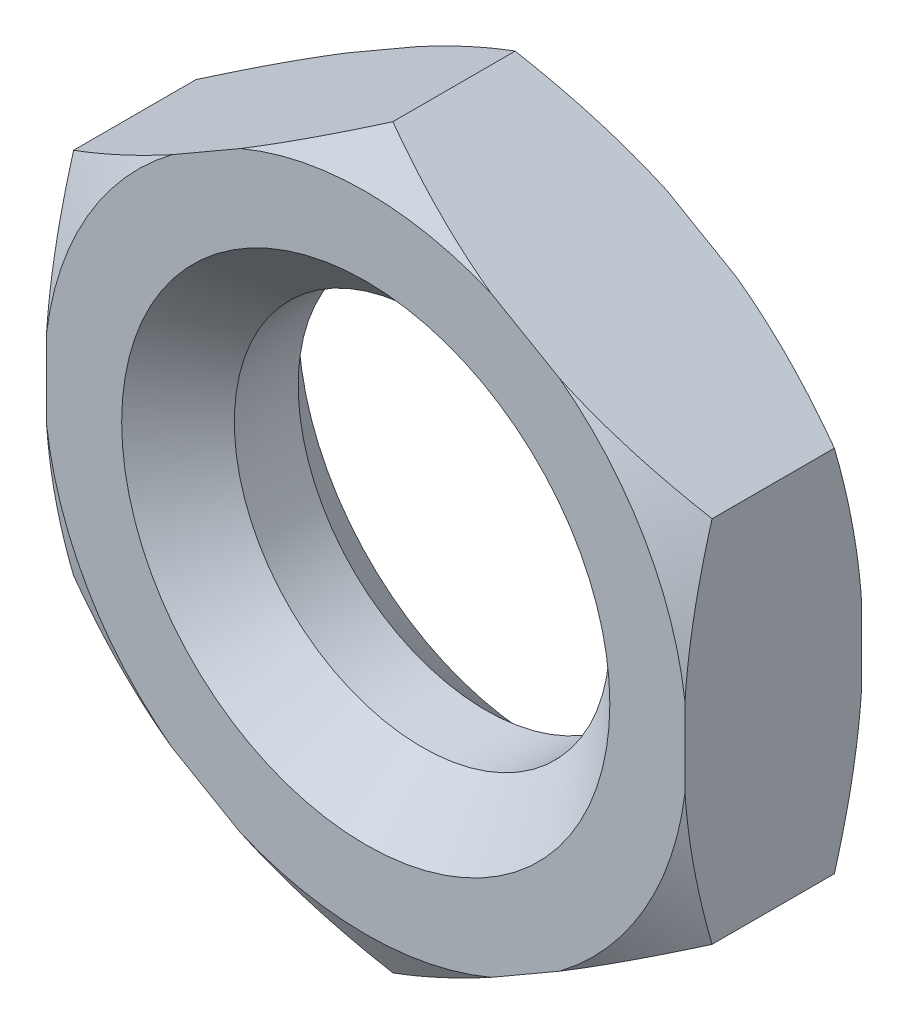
ISO-10303-21;
HEADER;
FILE_DESCRIPTION(('STEP AP214'),'2;1');
FILE_NAME('part.step','',(''),(''),'','','');
FILE_SCHEMA(('AUTOMOTIVE_DESIGN { 1 0 10303 214 1 1 1 1 }'));
ENDSEC;
DATA;
#1=APPLICATION_CONTEXT('core data for automotive mechanical design processes');
#2=APPLICATION_PROTOCOL_DEFINITION('international standard','automotive_design',2000,#1);
#3=PRODUCT_CONTEXT('',#1,'mechanical');
#4=PRODUCT('Part','Part','',(#3));
#5=PRODUCT_RELATED_PRODUCT_CATEGORY('part','',(#4));
#6=PRODUCT_DEFINITION_FORMATION('','',#4);
#7=PRODUCT_DEFINITION_CONTEXT('part definition',#1,'design');
#8=PRODUCT_DEFINITION('design','',#6,#7);
#9=PRODUCT_DEFINITION_SHAPE('','',#8);
#10=(LENGTH_UNIT() NAMED_UNIT(*) SI_UNIT(.MILLI.,.METRE.));
#11=(NAMED_UNIT(*) PLANE_ANGLE_UNIT() SI_UNIT($,.RADIAN.));
#12=(NAMED_UNIT(*) SI_UNIT($,.STERADIAN.) SOLID_ANGLE_UNIT());
#13=UNCERTAINTY_MEASURE_WITH_UNIT(LENGTH_MEASURE(1.E-05),#10,'distance_accuracy_value','');
#14=(GEOMETRIC_REPRESENTATION_CONTEXT(3) GLOBAL_UNCERTAINTY_ASSIGNED_CONTEXT((#13)) GLOBAL_UNIT_ASSIGNED_CONTEXT((#10,
#11,#12)) REPRESENTATION_CONTEXT('',''));
#15=CARTESIAN_POINT('',(0.,0.,0.));
#16=DIRECTION('',(0.,0.,1.));
#17=DIRECTION('',(1.,0.,0.));
#18=AXIS2_PLACEMENT_3D('',#15,#16,#17);
#19=CARTESIAN_POINT('',(8.5,4.90747728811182,2.35));
#20=DIRECTION('',(-0.5,-0.866025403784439,0.));
#21=DIRECTION('',(0.866025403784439,-0.5,0.));
#22=AXIS2_PLACEMENT_3D('',#19,#20,#21);
#23=PLANE('',#22);
#24=CARTESIAN_POINT('',(-5.90507087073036,13.2242488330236,1.06665217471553));
#25=CARTESIAN_POINT('',(-5.63799011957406,13.0700496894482,0.922520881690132));
#26=CARTESIAN_POINT('',(-5.37027055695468,12.9154817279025,0.779943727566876));
#27=CARTESIAN_POINT('',(-4.83328443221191,12.6054526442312,0.498627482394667));
#28=CARTESIAN_POINT('',(-4.5640176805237,12.4499914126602,0.359888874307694));
#29=CARTESIAN_POINT('',(-4.0228683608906,12.1375587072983,0.0865784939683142));
#30=CARTESIAN_POINT('',(-3.75098017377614,11.9805839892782,-0.0479784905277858));
#31=CARTESIAN_POINT('',(-3.20516765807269,11.6654589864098,-0.311456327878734));
#32=CARTESIAN_POINT('',(-2.93124339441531,11.5073087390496,-0.440377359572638));
#33=CARTESIAN_POINT('',(-2.37402843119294,11.1856005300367,-0.694544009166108));
#34=CARTESIAN_POINT('',(-2.09067683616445,11.0220074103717,-0.819612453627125));
#35=CARTESIAN_POINT('',(-1.52111624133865,10.6931714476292,-1.06084689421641));
#36=CARTESIAN_POINT('',(-1.23490710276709,10.5279285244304,-1.17701245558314));
#37=CARTESIAN_POINT('',(-0.659564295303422,10.1957541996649,-1.39823134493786));
#38=CARTESIAN_POINT('',(-0.370433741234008,10.028824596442,-1.50329536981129));
#39=CARTESIAN_POINT('',(0.211221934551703,9.69300553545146,-1.69988732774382));
#40=CARTESIAN_POINT('',(0.503746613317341,9.52411633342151,-1.79141700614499));
#41=CARTESIAN_POINT('',(1.20327585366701,9.12024293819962,-1.9893958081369));
#42=CARTESIAN_POINT('',(1.61190973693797,8.88431805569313,-2.0884843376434));
#43=CARTESIAN_POINT('',(2.22904112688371,8.52801708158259,-2.20761125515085));
#44=CARTESIAN_POINT('',(2.43543837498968,8.4088535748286,-2.24240162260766));
#45=CARTESIAN_POINT('',(2.84939185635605,8.16985742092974,-2.30127830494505));
#46=CARTESIAN_POINT('',(3.05694807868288,8.05002478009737,-2.32536472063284));
#47=CARTESIAN_POINT('',(3.47040435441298,7.81131568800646,-2.36192589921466));
#48=CARTESIAN_POINT('',(3.67629563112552,7.69244430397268,-2.37453232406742));
#49=CARTESIAN_POINT('',(4.08836628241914,7.45453520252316,-2.38823579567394));
#50=CARTESIAN_POINT('',(4.29454565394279,7.33549748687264,-2.3893329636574));
#51=CARTESIAN_POINT('',(4.70670551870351,7.09753687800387,-2.37998310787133));
#52=CARTESIAN_POINT('',(4.91268601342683,6.97861398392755,-2.36953617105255));
#53=CARTESIAN_POINT('',(5.32401108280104,6.74113534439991,-2.33741437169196));
#54=CARTESIAN_POINT('',(5.52935555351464,6.62257965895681,-2.31573776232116));
#55=CARTESIAN_POINT('',(6.0142832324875,6.34260653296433,-2.25183776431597));
#56=CARTESIAN_POINT('',(6.29341300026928,6.18145088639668,-2.20499080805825));
#57=CARTESIAN_POINT('',(6.84900519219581,5.86067958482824,-2.09361024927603));
#58=CARTESIAN_POINT('',(7.12546722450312,5.70106415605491,-2.02907408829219));
#59=CARTESIAN_POINT('',(7.67568842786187,5.3833937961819,-1.88475105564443));
#60=CARTESIAN_POINT('',(7.94944417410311,5.22534084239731,-1.80494695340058));
#61=CARTESIAN_POINT('',(8.49388457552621,4.91100803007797,-1.63260246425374));
#62=CARTESIAN_POINT('',(8.76456942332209,4.75472806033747,-1.54006288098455));
#63=CARTESIAN_POINT('',(9.30626543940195,4.44197971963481,-1.34327988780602));
#64=CARTESIAN_POINT('',(9.57724186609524,4.2855314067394,-1.23890985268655));
#65=CARTESIAN_POINT('',(10.1163237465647,3.97429233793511,-1.0213923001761));
#66=CARTESIAN_POINT('',(10.3844309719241,3.81950055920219,-0.908250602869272));
#67=CARTESIAN_POINT('',(10.918201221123,3.5113281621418,-0.674744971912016));
#68=CARTESIAN_POINT('',(11.1838647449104,3.35794725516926,-0.554382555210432));
#69=CARTESIAN_POINT('',(11.7131077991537,3.05238863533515,-0.307698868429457));
#70=CARTESIAN_POINT('',(11.9766872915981,2.90021094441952,-0.181377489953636));
#71=CARTESIAN_POINT('',(12.4223414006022,2.64291242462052,0.0371216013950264));
#72=CARTESIAN_POINT('',(12.6048840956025,2.53752135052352,0.128031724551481));
#73=CARTESIAN_POINT('',(12.9691661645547,2.32720299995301,0.31195394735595));
#74=CARTESIAN_POINT('',(13.1509055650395,2.22227570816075,0.404965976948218));
#75=CARTESIAN_POINT('',(13.5117426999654,2.01394629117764,0.591848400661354));
#76=CARTESIAN_POINT('',(13.6908480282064,1.9105397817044,0.685699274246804));
#77=CARTESIAN_POINT('',(14.0484216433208,1.70409455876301,0.875015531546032));
#78=CARTESIAN_POINT('',(14.2268899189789,1.60105585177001,0.970480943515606));
#79=CARTESIAN_POINT('',(14.4050708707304,1.49818303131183,1.06665217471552));
#80=B_SPLINE_CURVE_WITH_KNOTS('',3,(#24,#25,#26,#27,#28,#29,#30,#31,#32,#33,#34,#35,#36,#37,#38,
#39,#40,#41,#42,#43,#44,#45,#46,#47,#48,#49,#50,#51,#52,#53,#54,#55,#56,#57,#58,#59,#60,#61,#62,
#63,#64,#65,#66,#67,#68,#69,#70,#71,#72,#73,#74,#75,#76,#77,#78,#79),.UNSPECIFIED.,.F.,.F.,(4,2,
2,2,2,2,2,2,2,2,2,2,2,2,2,2,2,2,2,2,2,2,2,2,2,2,2,4),(0.,1.0212601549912,2.04264822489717,
3.06731144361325,4.09194212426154,5.14266283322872,6.19343482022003,7.24318492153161,
8.29279953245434,9.73765676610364,10.4600162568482,11.1823689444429,11.8963287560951,
12.610281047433,13.3242279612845,14.038285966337,15.0147893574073,15.991434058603,
16.9691875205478,17.9468793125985,18.9362523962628,19.9249745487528,20.9134897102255,
21.902022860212,22.5906653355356,23.2792848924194,23.9606121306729,24.6419513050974),.UNSPECIFIED.);
#81=CARTESIAN_POINT('',(0.,9.81495457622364,-1.62831216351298));
#82=VERTEX_POINT('',#81);
#83=CARTESIAN_POINT('',(3.33822416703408,7.8876299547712,-2.35));
#84=VERTEX_POINT('',#83);
#85=EDGE_CURVE('E177',#82,#84,#80,.T.);
#86=ORIENTED_EDGE('',*,*,#85,.F.);
#87=DIRECTION('',(0.,0.,-1.));
#88=VECTOR('',#87,1.);
#89=CARTESIAN_POINT('',(0.,9.81495457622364,2.35));
#90=LINE('',#89,#88);
#91=CARTESIAN_POINT('',(0.,9.81495457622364,1.62831216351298));
#92=VERTEX_POINT('',#91);
#93=EDGE_CURVE('E222',#92,#82,#90,.T.);
#94=ORIENTED_EDGE('',*,*,#93,.F.);
#95=CARTESIAN_POINT('',(14.4050708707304,1.49818303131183,-1.06665217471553));
#96=CARTESIAN_POINT('',(14.1379901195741,1.65238217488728,-0.922520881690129));
#97=CARTESIAN_POINT('',(13.8702705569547,1.80695013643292,-0.779943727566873));
#98=CARTESIAN_POINT('',(13.3332844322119,2.11697922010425,-0.498627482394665));
#99=CARTESIAN_POINT('',(13.0640176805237,2.27244045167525,-0.359888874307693));
#100=CARTESIAN_POINT('',(12.5228683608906,2.58487315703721,-0.0865784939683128));
#101=CARTESIAN_POINT('',(12.2509801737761,2.74184787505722,0.0479784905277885));
#102=CARTESIAN_POINT('',(11.7051676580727,3.05697287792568,0.311456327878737));
#103=CARTESIAN_POINT('',(11.4312433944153,3.21512312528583,0.440377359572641));
#104=CARTESIAN_POINT('',(10.8740284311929,3.53683133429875,0.694544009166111));
#105=CARTESIAN_POINT('',(10.5906768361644,3.70042445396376,0.819612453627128));
#106=CARTESIAN_POINT('',(10.0211162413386,4.02926041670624,1.06084689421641));
#107=CARTESIAN_POINT('',(9.73490710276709,4.19450333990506,1.17701245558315));
#108=CARTESIAN_POINT('',(9.15956429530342,4.52667766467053,1.39823134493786));
#109=CARTESIAN_POINT('',(8.87043374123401,4.69360726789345,1.50329536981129));
#110=CARTESIAN_POINT('',(8.28877806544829,5.029426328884,1.69988732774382));
#111=CARTESIAN_POINT('',(7.99625338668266,5.19831553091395,1.79141700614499));
#112=CARTESIAN_POINT('',(7.29672414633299,5.60218892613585,1.9893958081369));
#113=CARTESIAN_POINT('',(6.88809026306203,5.83811380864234,2.08848433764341));
#114=CARTESIAN_POINT('',(6.27095887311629,6.19441478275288,2.20761125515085));
#115=CARTESIAN_POINT('',(6.06456162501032,6.31357828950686,2.24240162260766));
#116=CARTESIAN_POINT('',(5.65060814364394,6.55257444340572,2.30127830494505));
#117=CARTESIAN_POINT('',(5.44305192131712,6.67240708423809,2.32536472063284));
#118=CARTESIAN_POINT('',(5.02959564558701,6.91111617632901,2.36192589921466));
#119=CARTESIAN_POINT('',(4.82370436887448,7.02998756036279,2.37453232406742));
#120=CARTESIAN_POINT('',(4.41163371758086,7.2678966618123,2.38823579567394));
#121=CARTESIAN_POINT('',(4.20545434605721,7.38693437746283,2.3893329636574));
#122=CARTESIAN_POINT('',(3.79329448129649,7.62489498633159,2.37998310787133));
#123=CARTESIAN_POINT('',(3.58731398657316,7.74381788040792,2.36953617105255));
#124=CARTESIAN_POINT('',(3.17598891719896,7.98129651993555,2.33741437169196));
#125=CARTESIAN_POINT('',(2.97064444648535,8.09985220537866,2.31573776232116));
#126=CARTESIAN_POINT('',(2.4857167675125,8.37982533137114,2.25183776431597));
#127=CARTESIAN_POINT('',(2.20658699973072,8.54098097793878,2.20499080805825));
#128=CARTESIAN_POINT('',(1.65099480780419,8.86175227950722,2.09361024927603));
#129=CARTESIAN_POINT('',(1.37453277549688,9.02136770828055,2.02907408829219));
#130=CARTESIAN_POINT('',(0.824311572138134,9.33903806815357,1.88475105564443));
#131=CARTESIAN_POINT('',(0.550555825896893,9.49709102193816,1.80494695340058));
#132=CARTESIAN_POINT('',(0.00611542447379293,9.81142383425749,1.63260246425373));
#133=CARTESIAN_POINT('',(-0.26456942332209,9.96770380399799,1.54006288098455));
#134=CARTESIAN_POINT('',(-0.806265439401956,10.2804521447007,1.34327988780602));
#135=CARTESIAN_POINT('',(-1.07724186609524,10.4369004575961,1.23890985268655));
#136=CARTESIAN_POINT('',(-1.6163237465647,10.7481395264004,1.02139230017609));
#137=CARTESIAN_POINT('',(-1.88443097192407,10.9029313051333,0.908250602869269));
#138=CARTESIAN_POINT('',(-2.41820122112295,11.2111037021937,0.674744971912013));
#139=CARTESIAN_POINT('',(-2.6838647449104,11.3644846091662,0.554382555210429));
#140=CARTESIAN_POINT('',(-3.21310779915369,11.6700432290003,0.307698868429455));
#141=CARTESIAN_POINT('',(-3.47668729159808,11.8222209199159,0.181377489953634));
#142=CARTESIAN_POINT('',(-3.92234140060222,12.0795194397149,-0.0371216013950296));
#143=CARTESIAN_POINT('',(-4.10488409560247,12.1849105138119,-0.128031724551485));
#144=CARTESIAN_POINT('',(-4.46916616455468,12.3952288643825,-0.311953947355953));
#145=CARTESIAN_POINT('',(-4.65090556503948,12.5001561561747,-0.40496597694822));
#146=CARTESIAN_POINT('',(-5.01174269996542,12.7084855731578,-0.591848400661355));
#147=CARTESIAN_POINT('',(-5.19084802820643,12.8118920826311,-0.685699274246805));
#148=CARTESIAN_POINT('',(-5.54842164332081,13.0183373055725,-0.875015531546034));
#149=CARTESIAN_POINT('',(-5.72688991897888,13.1213760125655,-0.970480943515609));
#150=CARTESIAN_POINT('',(-5.90507087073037,13.2242488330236,-1.06665217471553));
#151=B_SPLINE_CURVE_WITH_KNOTS('',3,(#95,#96,#97,#98,#99,#100,#101,#102,#103,#104,#105,#106,
#107,#108,#109,#110,#111,#112,#113,#114,#115,#116,#117,#118,#119,#120,#121,#122,#123,#124,#125,
#126,#127,#128,#129,#130,#131,#132,#133,#134,#135,#136,#137,#138,#139,#140,#141,#142,#143,#144,
#145,#146,#147,#148,#149,#150),.UNSPECIFIED.,.F.,.F.,(4,2,2,2,2,2,2,2,2,2,2,2,2,2,2,2,2,2,2,2,2,
2,2,2,2,2,2,4),(0.,1.0212601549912,2.04264822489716,3.06731144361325,4.09194212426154,
5.14266283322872,6.19343482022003,7.24318492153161,8.29279953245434,9.73765676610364,
10.4600162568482,11.1823689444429,11.8963287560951,12.610281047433,13.3242279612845,
14.038285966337,15.0147893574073,15.991434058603,16.9691875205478,17.9468793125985,
18.9362523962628,19.9249745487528,20.9134897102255,21.902022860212,22.5906653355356,
23.2792848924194,23.9606121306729,24.6419513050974),.UNSPECIFIED.);
#152=CARTESIAN_POINT('',(3.33822416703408,7.8876299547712,2.35));
#153=VERTEX_POINT('',#152);
#154=EDGE_CURVE('E374',#153,#92,#151,.T.);
#155=ORIENTED_EDGE('',*,*,#154,.F.);
#156=DIRECTION('',(-0.866025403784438,0.5,0.));
#157=VECTOR('',#156,1.);
#158=CARTESIAN_POINT('',(8.5,4.90747728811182,2.35));
#159=LINE('',#158,#157);
#160=CARTESIAN_POINT('',(5.16177583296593,6.83480190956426,2.35));
#161=VERTEX_POINT('',#160);
#162=EDGE_CURVE('E353',#161,#153,#159,.T.);
#163=ORIENTED_EDGE('',*,*,#162,.F.);
#164=CARTESIAN_POINT('',(8.5,4.90747728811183,1.62831216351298));
#165=VERTEX_POINT('',#164);
#166=EDGE_CURVE('E194',#165,#161,#151,.T.);
#167=ORIENTED_EDGE('',*,*,#166,.F.);
#168=DIRECTION('',(0.,0.,-1.));
#169=VECTOR('',#168,1.);
#170=CARTESIAN_POINT('',(8.5,4.90747728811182,2.35));
#171=LINE('',#170,#169);
#172=CARTESIAN_POINT('',(8.5,4.90747728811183,-1.62831216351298));
#173=VERTEX_POINT('',#172);
#174=EDGE_CURVE('E183',#165,#173,#171,.T.);
#175=ORIENTED_EDGE('',*,*,#174,.T.);
#176=CARTESIAN_POINT('',(5.16177583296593,6.83480190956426,-2.35));
#177=VERTEX_POINT('',#176);
#178=EDGE_CURVE('E164',#177,#173,#80,.T.);
#179=ORIENTED_EDGE('',*,*,#178,.F.);
#180=DIRECTION('',(-0.866025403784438,0.5,0.));
#181=VECTOR('',#180,1.);
#182=CARTESIAN_POINT('',(8.5,4.90747728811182,-2.35));
#183=LINE('',#182,#181);
#184=EDGE_CURVE('E265',#177,#84,#183,.T.);
#185=ORIENTED_EDGE('',*,*,#184,.T.);
#186=EDGE_LOOP('',(#86,#94,#155,#163,#167,#175,#179,#185));
#187=FACE_BOUND('',#186,.T.);
#188=ADVANCED_FACE('F39',(#187),#23,.F.);
#189=CARTESIAN_POINT('',(0.,9.81495457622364,2.35));
#190=DIRECTION('',(0.5,-0.866025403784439,0.));
#191=DIRECTION('',(0.866025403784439,0.5,0.));
#192=AXIS2_PLACEMENT_3D('',#189,#190,#191);
#193=PLANE('',#192);
#194=CARTESIAN_POINT('',(-14.4050708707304,1.49818303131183,1.06665217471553));
#195=CARTESIAN_POINT('',(-14.1379901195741,1.65238217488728,0.922520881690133));
#196=CARTESIAN_POINT('',(-13.8702705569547,1.80695013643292,0.779943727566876));
#197=CARTESIAN_POINT('',(-13.3332844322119,2.11697922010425,0.498627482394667));
#198=CARTESIAN_POINT('',(-13.0640176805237,2.27244045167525,0.359888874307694));
#199=CARTESIAN_POINT('',(-12.5228683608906,2.58487315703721,0.0865784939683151));
#200=CARTESIAN_POINT('',(-12.2509801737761,2.74184787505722,-0.0479784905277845));
#201=CARTESIAN_POINT('',(-11.7051676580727,3.05697287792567,-0.311456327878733));
#202=CARTESIAN_POINT('',(-11.4312433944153,3.21512312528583,-0.440377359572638));
#203=CARTESIAN_POINT('',(-10.8740284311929,3.53683133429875,-0.694544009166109));
#204=CARTESIAN_POINT('',(-10.5906768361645,3.70042445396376,-0.819612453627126));
#205=CARTESIAN_POINT('',(-10.0211162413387,4.02926041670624,-1.06084689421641));
#206=CARTESIAN_POINT('',(-9.73490710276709,4.19450333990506,-1.17701245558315));
#207=CARTESIAN_POINT('',(-9.15956429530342,4.52667766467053,-1.39823134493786));
#208=CARTESIAN_POINT('',(-8.87043374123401,4.69360726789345,-1.50329536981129));
#209=CARTESIAN_POINT('',(-8.2887780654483,5.029426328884,-1.69988732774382));
#210=CARTESIAN_POINT('',(-7.99625338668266,5.19831553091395,-1.79141700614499));
#211=CARTESIAN_POINT('',(-7.29672414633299,5.60218892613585,-1.9893958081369));
#212=CARTESIAN_POINT('',(-6.88809026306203,5.83811380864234,-2.0884843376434));
#213=CARTESIAN_POINT('',(-6.27095887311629,6.19441478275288,-2.20761125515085));
#214=CARTESIAN_POINT('',(-6.06456162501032,6.31357828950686,-2.24240162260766));
#215=CARTESIAN_POINT('',(-5.65060814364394,6.55257444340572,-2.30127830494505));
#216=CARTESIAN_POINT('',(-5.44305192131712,6.67240708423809,-2.32536472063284));
#217=CARTESIAN_POINT('',(-5.02959564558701,6.91111617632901,-2.36192589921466));
#218=CARTESIAN_POINT('',(-4.82370436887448,7.02998756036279,-2.37453232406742));
#219=CARTESIAN_POINT('',(-4.41163371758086,7.2678966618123,-2.38823579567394));
#220=CARTESIAN_POINT('',(-4.20545434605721,7.38693437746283,-2.3893329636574));
#221=CARTESIAN_POINT('',(-3.79329448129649,7.62489498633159,-2.37998310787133));
#222=CARTESIAN_POINT('',(-3.58731398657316,7.74381788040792,-2.36953617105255));
#223=CARTESIAN_POINT('',(-3.17598891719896,7.98129651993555,-2.33741437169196));
#224=CARTESIAN_POINT('',(-2.97064444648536,8.09985220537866,-2.31573776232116));
#225=CARTESIAN_POINT('',(-2.4857167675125,8.37982533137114,-2.25183776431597));
#226=CARTESIAN_POINT('',(-2.20658699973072,8.54098097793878,-2.20499080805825));
#227=CARTESIAN_POINT('',(-1.65099480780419,8.86175227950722,-2.09361024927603));
#228=CARTESIAN_POINT('',(-1.37453277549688,9.02136770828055,-2.02907408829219));
#229=CARTESIAN_POINT('',(-0.824311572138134,9.33903806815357,-1.88475105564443));
#230=CARTESIAN_POINT('',(-0.550555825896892,9.49709102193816,-1.80494695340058));
#231=CARTESIAN_POINT('',(-0.00611542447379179,9.81142383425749,-1.63260246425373));
#232=CARTESIAN_POINT('',(0.264569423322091,9.967703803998,-1.54006288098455));
#233=CARTESIAN_POINT('',(0.806265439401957,10.2804521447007,-1.34327988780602));
#234=CARTESIAN_POINT('',(1.07724186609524,10.4369004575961,-1.23890985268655));
#235=CARTESIAN_POINT('',(1.6163237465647,10.7481395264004,-1.02139230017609));
#236=CARTESIAN_POINT('',(1.88443097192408,10.9029313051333,-0.908250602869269));
#237=CARTESIAN_POINT('',(2.41820122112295,11.2111037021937,-0.674744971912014));
#238=CARTESIAN_POINT('',(2.6838647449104,11.3644846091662,-0.55438255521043));
#239=CARTESIAN_POINT('',(3.21310779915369,11.6700432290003,-0.307698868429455));
#240=CARTESIAN_POINT('',(3.47668729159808,11.8222209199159,-0.181377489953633));
#241=CARTESIAN_POINT('',(3.92234140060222,12.0795194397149,0.0371216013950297));
#242=CARTESIAN_POINT('',(4.10488409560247,12.1849105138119,0.128031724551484));
#243=CARTESIAN_POINT('',(4.46916616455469,12.3952288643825,0.311953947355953));
#244=CARTESIAN_POINT('',(4.65090556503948,12.5001561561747,0.40496597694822));
#245=CARTESIAN_POINT('',(5.01174269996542,12.7084855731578,0.591848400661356));
#246=CARTESIAN_POINT('',(5.19084802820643,12.8118920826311,0.685699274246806));
#247=CARTESIAN_POINT('',(5.54842164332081,13.0183373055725,0.875015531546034));
#248=CARTESIAN_POINT('',(5.72688991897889,13.1213760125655,0.970480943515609));
#249=CARTESIAN_POINT('',(5.90507087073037,13.2242488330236,1.06665217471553));
#250=B_SPLINE_CURVE_WITH_KNOTS('',3,(#194,#195,#196,#197,#198,#199,#200,#201,#202,#203,#204,
#205,#206,#207,#208,#209,#210,#211,#212,#213,#214,#215,#216,#217,#218,#219,#220,#221,#222,#223,
#224,#225,#226,#227,#228,#229,#230,#231,#232,#233,#234,#235,#236,#237,#238,#239,#240,#241,#242,
#243,#244,#245,#246,#247,#248,#249),.UNSPECIFIED.,.F.,.F.,(4,2,2,2,2,2,2,2,2,2,2,2,2,2,2,2,2,2,
2,2,2,2,2,2,2,2,2,4),(0.,1.0212601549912,2.04264822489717,3.06731144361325,4.09194212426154,
5.14266283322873,6.19343482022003,7.24318492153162,8.29279953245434,9.73765676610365,
10.4600162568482,11.1823689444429,11.8963287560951,12.610281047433,13.3242279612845,
14.038285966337,15.0147893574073,15.991434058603,16.9691875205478,17.9468793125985,
18.9362523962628,19.9249745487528,20.9134897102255,21.902022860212,22.5906653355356,
23.2792848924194,23.9606121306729,24.6419513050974),.UNSPECIFIED.);
#251=CARTESIAN_POINT('',(-8.5,4.90747728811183,-1.62831216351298));
#252=VERTEX_POINT('',#251);
#253=CARTESIAN_POINT('',(-5.16177583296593,6.83480190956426,-2.35));
#254=VERTEX_POINT('',#253);
#255=EDGE_CURVE('E55',#252,#254,#250,.T.);
#256=ORIENTED_EDGE('',*,*,#255,.F.);
#257=DIRECTION('',(0.,0.,-1.));
#258=VECTOR('',#257,1.);
#259=CARTESIAN_POINT('',(-8.5,4.90747728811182,2.35));
#260=LINE('',#259,#258);
#261=CARTESIAN_POINT('',(-8.5,4.90747728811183,1.62831216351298));
#262=VERTEX_POINT('',#261);
#263=EDGE_CURVE('E218',#262,#252,#260,.T.);
#264=ORIENTED_EDGE('',*,*,#263,.F.);
#265=CARTESIAN_POINT('',(5.90507087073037,13.2242488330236,-1.06665217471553));
#266=CARTESIAN_POINT('',(5.63799011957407,13.0700496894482,-0.922520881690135));
#267=CARTESIAN_POINT('',(5.37027055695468,12.9154817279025,-0.779943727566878));
#268=CARTESIAN_POINT('',(4.83328443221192,12.6054526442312,-0.498627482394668));
#269=CARTESIAN_POINT('',(4.5640176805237,12.4499914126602,-0.359888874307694));
#270=CARTESIAN_POINT('',(4.0228683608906,12.1375587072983,-0.0865784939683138));
#271=CARTESIAN_POINT('',(3.75098017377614,11.9805839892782,0.0479784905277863));
#272=CARTESIAN_POINT('',(3.20516765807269,11.6654589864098,0.311456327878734));
#273=CARTESIAN_POINT('',(2.93124339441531,11.5073087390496,0.440377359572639));
#274=CARTESIAN_POINT('',(2.37402843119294,11.1856005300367,0.694544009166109));
#275=CARTESIAN_POINT('',(2.09067683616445,11.0220074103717,0.819612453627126));
#276=CARTESIAN_POINT('',(1.52111624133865,10.6931714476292,1.06084689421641));
#277=CARTESIAN_POINT('',(1.23490710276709,10.5279285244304,1.17701245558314));
#278=CARTESIAN_POINT('',(0.65956429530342,10.1957541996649,1.39823134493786));
#279=CARTESIAN_POINT('',(0.370433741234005,10.028824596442,1.50329536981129));
#280=CARTESIAN_POINT('',(-0.211221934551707,9.69300553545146,1.69988732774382));
#281=CARTESIAN_POINT('',(-0.503746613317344,9.52411633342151,1.79141700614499));
#282=CARTESIAN_POINT('',(-1.20327585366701,9.12024293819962,1.9893958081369));
#283=CARTESIAN_POINT('',(-1.61190973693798,8.88431805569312,2.0884843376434));
#284=CARTESIAN_POINT('',(-2.22904112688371,8.52801708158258,2.20761125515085));
#285=CARTESIAN_POINT('',(-2.43543837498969,8.4088535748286,2.24240162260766));
#286=CARTESIAN_POINT('',(-2.84939185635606,8.16985742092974,2.30127830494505));
#287=CARTESIAN_POINT('',(-3.05694807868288,8.05002478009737,2.32536472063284));
#288=CARTESIAN_POINT('',(-3.47040435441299,7.81131568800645,2.36192589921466));
#289=CARTESIAN_POINT('',(-3.67629563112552,7.69244430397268,2.37453232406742));
#290=CARTESIAN_POINT('',(-4.08836628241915,7.45453520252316,2.38823579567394));
#291=CARTESIAN_POINT('',(-4.29454565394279,7.33549748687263,2.3893329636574));
#292=CARTESIAN_POINT('',(-4.70670551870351,7.09753687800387,2.37998310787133));
#293=CARTESIAN_POINT('',(-4.91268601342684,6.97861398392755,2.36953617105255));
#294=CARTESIAN_POINT('',(-5.32401108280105,6.74113534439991,2.33741437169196));
#295=CARTESIAN_POINT('',(-5.52935555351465,6.62257965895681,2.31573776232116));
#296=CARTESIAN_POINT('',(-6.01428323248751,6.34260653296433,2.25183776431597));
#297=CARTESIAN_POINT('',(-6.29341300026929,6.18145088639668,2.20499080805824));
#298=CARTESIAN_POINT('',(-6.84900519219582,5.86067958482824,2.09361024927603));
#299=CARTESIAN_POINT('',(-7.12546722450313,5.70106415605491,2.02907408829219));
#300=CARTESIAN_POINT('',(-7.67568842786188,5.38339379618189,1.88475105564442));
#301=CARTESIAN_POINT('',(-7.94944417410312,5.2253408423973,1.80494695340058));
#302=CARTESIAN_POINT('',(-8.49388457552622,4.91100803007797,1.63260246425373));
#303=CARTESIAN_POINT('',(-8.7645694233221,4.75472806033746,1.54006288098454));
#304=CARTESIAN_POINT('',(-9.30626543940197,4.4419797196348,1.34327988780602));
#305=CARTESIAN_POINT('',(-9.57724186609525,4.28553140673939,1.23890985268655));
#306=CARTESIAN_POINT('',(-10.1163237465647,3.9742923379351,1.02139230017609));
#307=CARTESIAN_POINT('',(-10.3844309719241,3.81950055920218,0.908250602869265));
#308=CARTESIAN_POINT('',(-10.918201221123,3.51132816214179,0.674744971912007));
#309=CARTESIAN_POINT('',(-11.1838647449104,3.35794725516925,0.554382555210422));
#310=CARTESIAN_POINT('',(-11.7131077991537,3.05238863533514,0.307698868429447));
#311=CARTESIAN_POINT('',(-11.9766872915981,2.90021094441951,0.181377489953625));
#312=CARTESIAN_POINT('',(-12.4223414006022,2.64291242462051,-0.0371216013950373));
#313=CARTESIAN_POINT('',(-12.6048840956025,2.53752135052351,-0.128031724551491));
#314=CARTESIAN_POINT('',(-12.9691661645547,2.327202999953,-0.311953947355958));
#315=CARTESIAN_POINT('',(-13.1509055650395,2.22227570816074,-0.404965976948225));
#316=CARTESIAN_POINT('',(-13.5117426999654,2.01394629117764,-0.59184840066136));
#317=CARTESIAN_POINT('',(-13.6908480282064,1.9105397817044,-0.68569927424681));
#318=CARTESIAN_POINT('',(-14.0484216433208,1.70409455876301,-0.875015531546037));
#319=CARTESIAN_POINT('',(-14.2268899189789,1.60105585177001,-0.970480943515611));
#320=CARTESIAN_POINT('',(-14.4050708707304,1.49818303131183,-1.06665217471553));
#321=B_SPLINE_CURVE_WITH_KNOTS('',3,(#265,#266,#267,#268,#269,#270,#271,#272,#273,#274,#275,
#276,#277,#278,#279,#280,#281,#282,#283,#284,#285,#286,#287,#288,#289,#290,#291,#292,#293,#294,
#295,#296,#297,#298,#299,#300,#301,#302,#303,#304,#305,#306,#307,#308,#309,#310,#311,#312,#313,
#314,#315,#316,#317,#318,#319,#320),.UNSPECIFIED.,.F.,.F.,(4,2,2,2,2,2,2,2,2,2,2,2,2,2,2,2,2,2,
2,2,2,2,2,2,2,2,2,4),(0.,1.0212601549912,2.04264822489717,3.06731144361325,4.09194212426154,
5.14266283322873,6.19343482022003,7.24318492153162,8.29279953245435,9.73765676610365,
10.4600162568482,11.182368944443,11.8963287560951,12.610281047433,13.3242279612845,
14.038285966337,15.0147893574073,15.9914340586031,16.9691875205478,17.9468793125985,
18.9362523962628,19.9249745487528,20.9134897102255,21.902022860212,22.5906653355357,
23.2792848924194,23.9606121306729,24.6419513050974),.UNSPECIFIED.);
#322=CARTESIAN_POINT('',(-5.16177583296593,6.83480190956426,2.35));
#323=VERTEX_POINT('',#322);
#324=EDGE_CURVE('E346',#323,#262,#321,.T.);
#325=ORIENTED_EDGE('',*,*,#324,.F.);
#326=DIRECTION('',(-0.866025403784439,-0.5,0.));
#327=VECTOR('',#326,1.);
#328=CARTESIAN_POINT('',(0.,9.81495457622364,2.35));
#329=LINE('',#328,#327);
#330=CARTESIAN_POINT('',(-3.33822416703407,7.88762995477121,2.35));
#331=VERTEX_POINT('',#330);
#332=EDGE_CURVE('E357',#331,#323,#329,.T.);
#333=ORIENTED_EDGE('',*,*,#332,.F.);
#334=EDGE_CURVE('E352',#92,#331,#321,.T.);
#335=ORIENTED_EDGE('',*,*,#334,.F.);
#336=ORIENTED_EDGE('',*,*,#93,.T.);
#337=CARTESIAN_POINT('',(-3.33822416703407,7.88762995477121,-2.35));
#338=VERTEX_POINT('',#337);
#339=EDGE_CURVE('E408',#338,#82,#250,.T.);
#340=ORIENTED_EDGE('',*,*,#339,.F.);
#341=DIRECTION('',(-0.866025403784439,-0.5,0.));
#342=VECTOR('',#341,1.);
#343=CARTESIAN_POINT('',(0.,9.81495457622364,-2.35));
#344=LINE('',#343,#342);
#345=EDGE_CURVE('E373',#338,#254,#344,.T.);
#346=ORIENTED_EDGE('',*,*,#345,.T.);
#347=EDGE_LOOP('',(#256,#264,#325,#333,#335,#336,#340,#346));
#348=FACE_BOUND('',#347,.T.);
#349=ADVANCED_FACE('F326',(#348),#193,.F.);
#350=CARTESIAN_POINT('',(-8.5,4.90747728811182,2.35));
#351=DIRECTION('',(1.,0.,0.));
#352=DIRECTION('',(0.,0.,-1.));
#353=AXIS2_PLACEMENT_3D('',#350,#351,#352);
#354=PLANE('',#353);
#355=CARTESIAN_POINT('',(-8.5,-10.8125481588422,0.645659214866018));
#356=CARTESIAN_POINT('',(-8.5,-10.5054486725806,0.506306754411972));
#357=CARTESIAN_POINT('',(-8.5,-10.1975094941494,0.368769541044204));
#358=CARTESIAN_POINT('',(-8.5,-9.57959204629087,0.0982063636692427));
#359=CARTESIAN_POINT('',(-8.5,-9.26961341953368,-0.0348187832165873));
#360=CARTESIAN_POINT('',(-8.5,-8.6460693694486,-0.295970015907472));
#361=CARTESIAN_POINT('',(-8.5,-8.33249437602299,-0.424073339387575));
#362=CARTESIAN_POINT('',(-8.5,-7.70269446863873,-0.67357439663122));
#363=CARTESIAN_POINT('',(-8.5,-7.38646967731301,-0.794972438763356));
#364=CARTESIAN_POINT('',(-8.5,-6.75239517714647,-1.02904749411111));
#365=CARTESIAN_POINT('',(-8.5,-6.43455899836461,-1.14176097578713));
#366=CARTESIAN_POINT('',(-8.5,-5.79548991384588,-1.35723454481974));
#367=CARTESIAN_POINT('',(-8.5,-5.47425684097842,-1.45999413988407));
#368=CARTESIAN_POINT('',(-8.5,-4.82856101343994,-1.65320358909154));
#369=CARTESIAN_POINT('',(-8.5,-4.50410327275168,-1.74367007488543));
#370=CARTESIAN_POINT('',(-8.5,-3.85140158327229,-1.90988870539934));
#371=CARTESIAN_POINT('',(-8.5,-3.52315779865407,-1.98564148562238));
#372=CARTESIAN_POINT('',(-8.5,-2.9565329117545,-2.10068600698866));
#373=CARTESIAN_POINT('',(-8.5,-2.71901456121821,-2.1442289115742));
#374=CARTESIAN_POINT('',(-8.5,-2.24238579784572,-2.22132178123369));
#375=CARTESIAN_POINT('',(-8.5,-2.0032756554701,-2.25487340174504));
#376=CARTESIAN_POINT('',(-8.5,-1.52381534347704,-2.31110682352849));
#377=CARTESIAN_POINT('',(-8.5,-1.28346541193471,-2.33379063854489));
#378=CARTESIAN_POINT('',(-8.5,-0.801948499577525,-2.36763913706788));
#379=CARTESIAN_POINT('',(-8.5,-0.560781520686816,-2.37880384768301));
#380=CARTESIAN_POINT('',(-8.5,-0.0783124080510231,-2.38926599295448));
#381=CARTESIAN_POINT('',(-8.5,0.162989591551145,-2.38856955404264));
#382=CARTESIAN_POINT('',(-8.5,0.645264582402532,-2.37534660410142));
#383=CARTESIAN_POINT('',(-8.5,0.88623757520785,-2.36282014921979));
#384=CARTESIAN_POINT('',(-8.5,1.36733301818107,-2.32631969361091));
#385=CARTESIAN_POINT('',(-8.5,1.60745537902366,-2.3023445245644));
#386=CARTESIAN_POINT('',(-8.5,2.08637470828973,-2.24363681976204));
#387=CARTESIAN_POINT('',(-8.5,2.32517162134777,-2.20890383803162));
#388=CARTESIAN_POINT('',(-8.5,2.9202577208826,-2.10970931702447));
#389=CARTESIAN_POINT('',(-8.5,3.27552188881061,-2.03906972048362));
#390=CARTESIAN_POINT('',(-8.5,3.98178756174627,-1.87898494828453));
#391=CARTESIAN_POINT('',(-8.5,4.33278809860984,-1.78953558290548));
#392=CARTESIAN_POINT('',(-8.5,5.03122358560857,-1.5949960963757));
#393=CARTESIAN_POINT('',(-8.5,5.3786489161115,-1.48987177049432));
#394=CARTESIAN_POINT('',(-8.5,6.06940187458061,-1.26711124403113));
#395=CARTESIAN_POINT('',(-8.5,6.41272978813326,-1.14947592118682));
#396=CARTESIAN_POINT('',(-8.5,7.09967269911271,-0.902738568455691));
#397=CARTESIAN_POINT('',(-8.5,7.44324570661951,-0.773520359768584));
#398=CARTESIAN_POINT('',(-8.5,8.12717672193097,-0.506816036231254));
#399=CARTESIAN_POINT('',(-8.5,8.46753452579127,-0.369329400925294));
#400=CARTESIAN_POINT('',(-8.5,9.14336614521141,-0.0885863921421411));
#401=CARTESIAN_POINT('',(-8.5,9.47885717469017,0.0546287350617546));
#402=CARTESIAN_POINT('',(-8.5,10.1474074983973,0.346413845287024));
#403=CARTESIAN_POINT('',(-8.5,10.4804673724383,0.494982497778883));
#404=CARTESIAN_POINT('',(-8.5,10.8125481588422,0.645659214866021));
#405=B_SPLINE_CURVE_WITH_KNOTS('',3,(#355,#356,#357,#358,#359,#360,#361,#362,#363,#364,#365,
#366,#367,#368,#369,#370,#371,#372,#373,#374,#375,#376,#377,#378,#379,#380,#381,#382,#383,#384,
#385,#386,#387,#388,#389,#390,#391,#392,#393,#394,#395,#396,#397,#398,#399,#400,#401,#402,#403,
#404),.UNSPECIFIED.,.F.,.F.,(4,2,2,2,2,2,2,2,2,2,2,2,2,2,2,2,2,2,2,2,2,2,2,2,4),(0.,
1.01172864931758,2.02363955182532,3.039773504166,4.05586068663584,5.0674177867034,
6.07902489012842,7.08924944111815,8.09943034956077,8.82367557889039,9.54780074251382,
10.2717916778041,10.9957809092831,11.7193962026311,12.4430080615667,13.1666937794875,
13.890409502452,14.9764117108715,16.0626560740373,17.1513064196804,18.2398804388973,
19.3409567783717,20.4421024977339,21.5363932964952,22.6304139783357),.UNSPECIFIED.);
#406=CARTESIAN_POINT('',(-8.50000000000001,-4.90747728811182,-1.62831216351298));
#407=VERTEX_POINT('',#406);
#408=CARTESIAN_POINT('',(-8.5,-1.05282804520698,-2.35));
#409=VERTEX_POINT('',#408);
#410=EDGE_CURVE('E63',#407,#409,#405,.T.);
#411=ORIENTED_EDGE('',*,*,#410,.F.);
#412=DIRECTION('',(0.,0.,-1.));
#413=VECTOR('',#412,1.);
#414=CARTESIAN_POINT('',(-8.5,-4.90747728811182,2.35));
#415=LINE('',#414,#413);
#416=CARTESIAN_POINT('',(-8.50000000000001,-4.90747728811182,1.62831216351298));
#417=VERTEX_POINT('',#416);
#418=EDGE_CURVE('E214',#417,#407,#415,.T.);
#419=ORIENTED_EDGE('',*,*,#418,.F.);
#420=CARTESIAN_POINT('',(-8.5,10.8125481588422,-0.64565921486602));
#421=CARTESIAN_POINT('',(-8.5,10.5054486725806,-0.506306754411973));
#422=CARTESIAN_POINT('',(-8.5,10.1975094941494,-0.368769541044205));
#423=CARTESIAN_POINT('',(-8.5,9.57959204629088,-0.0982063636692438));
#424=CARTESIAN_POINT('',(-8.5,9.26961341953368,0.0348187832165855));
#425=CARTESIAN_POINT('',(-8.5,8.6460693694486,0.295970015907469));
#426=CARTESIAN_POINT('',(-8.5,8.33249437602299,0.424073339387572));
#427=CARTESIAN_POINT('',(-8.5,7.70269446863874,0.673574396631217));
#428=CARTESIAN_POINT('',(-8.5,7.38646967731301,0.794972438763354));
#429=CARTESIAN_POINT('',(-8.5,6.75239517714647,1.02904749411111));
#430=CARTESIAN_POINT('',(-8.5,6.43455899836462,1.14176097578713));
#431=CARTESIAN_POINT('',(-8.5,5.79548991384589,1.35723454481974));
#432=CARTESIAN_POINT('',(-8.5,5.47425684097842,1.45999413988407));
#433=CARTESIAN_POINT('',(-8.5,4.82856101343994,1.65320358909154));
#434=CARTESIAN_POINT('',(-8.5,4.50410327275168,1.74367007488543));
#435=CARTESIAN_POINT('',(-8.5,3.8514015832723,1.90988870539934));
#436=CARTESIAN_POINT('',(-8.5,3.52315779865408,1.98564148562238));
#437=CARTESIAN_POINT('',(-8.5,2.9565329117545,2.10068600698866));
#438=CARTESIAN_POINT('',(-8.5,2.71901456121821,2.1442289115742));
#439=CARTESIAN_POINT('',(-8.5,2.24238579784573,2.22132178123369));
#440=CARTESIAN_POINT('',(-8.5,2.00327565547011,2.25487340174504));
#441=CARTESIAN_POINT('',(-8.5,1.52381534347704,2.31110682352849));
#442=CARTESIAN_POINT('',(-8.5,1.28346541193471,2.33379063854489));
#443=CARTESIAN_POINT('',(-8.5,0.801948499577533,2.36763913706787));
#444=CARTESIAN_POINT('',(-8.5,0.560781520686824,2.37880384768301));
#445=CARTESIAN_POINT('',(-8.5,0.0783124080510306,2.38926599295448));
#446=CARTESIAN_POINT('',(-8.5,-0.162989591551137,2.38856955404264));
#447=CARTESIAN_POINT('',(-8.5,-0.645264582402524,2.37534660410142));
#448=CARTESIAN_POINT('',(-8.5,-0.886237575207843,2.36282014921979));
#449=CARTESIAN_POINT('',(-8.5,-1.36733301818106,2.32631969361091));
#450=CARTESIAN_POINT('',(-8.5,-1.60745537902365,2.3023445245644));
#451=CARTESIAN_POINT('',(-8.5,-2.08637470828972,2.24363681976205));
#452=CARTESIAN_POINT('',(-8.5,-2.32517162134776,2.20890383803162));
#453=CARTESIAN_POINT('',(-8.5,-2.92025772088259,2.10970931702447));
#454=CARTESIAN_POINT('',(-8.5,-3.2755218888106,2.03906972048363));
#455=CARTESIAN_POINT('',(-8.5,-3.98178756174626,1.87898494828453));
#456=CARTESIAN_POINT('',(-8.5,-4.33278809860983,1.78953558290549));
#457=CARTESIAN_POINT('',(-8.5,-5.03122358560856,1.5949960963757));
#458=CARTESIAN_POINT('',(-8.5,-5.37864891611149,1.48987177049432));
#459=CARTESIAN_POINT('',(-8.5,-6.06940187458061,1.26711124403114));
#460=CARTESIAN_POINT('',(-8.5,-6.41272978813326,1.14947592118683));
#461=CARTESIAN_POINT('',(-8.5,-7.09967269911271,0.902738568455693));
#462=CARTESIAN_POINT('',(-8.5,-7.4432457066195,0.773520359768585));
#463=CARTESIAN_POINT('',(-8.5,-8.12717672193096,0.506816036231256));
#464=CARTESIAN_POINT('',(-8.5,-8.46753452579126,0.369329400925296));
#465=CARTESIAN_POINT('',(-8.5,-9.14336614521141,0.0885863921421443));
#466=CARTESIAN_POINT('',(-8.5,-9.47885717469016,-0.0546287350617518));
#467=CARTESIAN_POINT('',(-8.5,-10.1474074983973,-0.346413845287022));
#468=CARTESIAN_POINT('',(-8.5,-10.4804673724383,-0.494982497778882));
#469=CARTESIAN_POINT('',(-8.5,-10.8125481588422,-0.645659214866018));
#470=B_SPLINE_CURVE_WITH_KNOTS('',3,(#420,#421,#422,#423,#424,#425,#426,#427,#428,#429,#430,
#431,#432,#433,#434,#435,#436,#437,#438,#439,#440,#441,#442,#443,#444,#445,#446,#447,#448,#449,
#450,#451,#452,#453,#454,#455,#456,#457,#458,#459,#460,#461,#462,#463,#464,#465,#466,#467,#468,
#469),.UNSPECIFIED.,.F.,.F.,(4,2,2,2,2,2,2,2,2,2,2,2,2,2,2,2,2,2,2,2,2,2,2,2,4),(0.,
1.01172864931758,2.02363955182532,3.039773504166,4.05586068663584,5.0674177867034,
6.07902489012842,7.08924944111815,8.09943034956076,8.82367557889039,9.54780074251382,
10.2717916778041,10.9957809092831,11.7193962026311,12.4430080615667,13.1666937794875,
13.890409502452,14.9764117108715,16.0626560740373,17.1513064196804,18.2398804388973,
19.3409567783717,20.4421024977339,21.5363932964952,22.6304139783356),.UNSPECIFIED.);
#471=CARTESIAN_POINT('',(-8.5,-1.05282804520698,2.35));
#472=VERTEX_POINT('',#471);
#473=EDGE_CURVE('E332',#472,#417,#470,.T.);
#474=ORIENTED_EDGE('',*,*,#473,.F.);
#475=DIRECTION('',(0.,-1.,0.));
#476=VECTOR('',#475,1.);
#477=CARTESIAN_POINT('',(-8.5,4.90747728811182,2.35));
#478=LINE('',#477,#476);
#479=CARTESIAN_POINT('',(-8.5,1.05282804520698,2.35));
#480=VERTEX_POINT('',#479);
#481=EDGE_CURVE('E361',#480,#472,#478,.T.);
#482=ORIENTED_EDGE('',*,*,#481,.F.);
#483=EDGE_CURVE('E339',#262,#480,#470,.T.);
#484=ORIENTED_EDGE('',*,*,#483,.F.);
#485=ORIENTED_EDGE('',*,*,#263,.T.);
#486=CARTESIAN_POINT('',(-8.5,1.05282804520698,-2.35));
#487=VERTEX_POINT('',#486);
#488=EDGE_CURVE('E315',#487,#252,#405,.T.);
#489=ORIENTED_EDGE('',*,*,#488,.F.);
#490=DIRECTION('',(0.,-1.,0.));
#491=VECTOR('',#490,1.);
#492=CARTESIAN_POINT('',(-8.5,4.90747728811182,-2.35));
#493=LINE('',#492,#491);
#494=EDGE_CURVE('E378',#487,#409,#493,.T.);
#495=ORIENTED_EDGE('',*,*,#494,.T.);
#496=EDGE_LOOP('',(#411,#419,#474,#482,#484,#485,#489,#495));
#497=FACE_BOUND('',#496,.T.);
#498=ADVANCED_FACE('F322',(#497),#354,.F.);
#499=CARTESIAN_POINT('',(-8.5,-4.90747728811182,2.35));
#500=DIRECTION('',(0.5,0.866025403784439,0.));
#501=DIRECTION('',(-0.866025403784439,0.5,0.));
#502=AXIS2_PLACEMENT_3D('',#499,#500,#501);
#503=PLANE('',#502);
#504=CARTESIAN_POINT('',(5.90507087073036,-13.2242488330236,1.06665217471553));
#505=CARTESIAN_POINT('',(5.63799011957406,-13.0700496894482,0.922520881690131));
#506=CARTESIAN_POINT('',(5.37027055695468,-12.9154817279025,0.779943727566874));
#507=CARTESIAN_POINT('',(4.83328443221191,-12.6054526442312,0.498627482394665));
#508=CARTESIAN_POINT('',(4.5640176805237,-12.4499914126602,0.359888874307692));
#509=CARTESIAN_POINT('',(4.02286836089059,-12.1375587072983,0.0865784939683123));
#510=CARTESIAN_POINT('',(3.75098017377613,-11.9805839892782,-0.0479784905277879));
#511=CARTESIAN_POINT('',(3.20516765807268,-11.6654589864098,-0.311456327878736));
#512=CARTESIAN_POINT('',(2.93124339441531,-11.5073087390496,-0.440377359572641));
#513=CARTESIAN_POINT('',(2.37402843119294,-11.1856005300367,-0.694544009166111));
#514=CARTESIAN_POINT('',(2.09067683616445,-11.0220074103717,-0.819612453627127));
#515=CARTESIAN_POINT('',(1.52111624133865,-10.6931714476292,-1.06084689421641));
#516=CARTESIAN_POINT('',(1.23490710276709,-10.5279285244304,-1.17701245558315));
#517=CARTESIAN_POINT('',(0.65956429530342,-10.1957541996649,-1.39823134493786));
#518=CARTESIAN_POINT('',(0.370433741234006,-10.028824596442,-1.50329536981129));
#519=CARTESIAN_POINT('',(-0.211221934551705,-9.69300553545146,-1.69988732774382));
#520=CARTESIAN_POINT('',(-0.503746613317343,-9.52411633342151,-1.79141700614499));
#521=CARTESIAN_POINT('',(-1.20327585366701,-9.12024293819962,-1.9893958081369));
#522=CARTESIAN_POINT('',(-1.61190973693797,-8.88431805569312,-2.08848433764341));
#523=CARTESIAN_POINT('',(-2.22904112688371,-8.52801708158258,-2.20761125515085));
#524=CARTESIAN_POINT('',(-2.43543837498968,-8.4088535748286,-2.24240162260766));
#525=CARTESIAN_POINT('',(-2.84939185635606,-8.16985742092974,-2.30127830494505));
#526=CARTESIAN_POINT('',(-3.05694807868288,-8.05002478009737,-2.32536472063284));
#527=CARTESIAN_POINT('',(-3.47040435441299,-7.81131568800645,-2.36192589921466));
#528=CARTESIAN_POINT('',(-3.67629563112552,-7.69244430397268,-2.37453232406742));
#529=CARTESIAN_POINT('',(-4.08836628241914,-7.45453520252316,-2.38823579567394));
#530=CARTESIAN_POINT('',(-4.29454565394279,-7.33549748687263,-2.3893329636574));
#531=CARTESIAN_POINT('',(-4.70670551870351,-7.09753687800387,-2.37998310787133));
#532=CARTESIAN_POINT('',(-4.91268601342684,-6.97861398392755,-2.36953617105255));
#533=CARTESIAN_POINT('',(-5.32401108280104,-6.74113534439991,-2.33741437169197));
#534=CARTESIAN_POINT('',(-5.52935555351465,-6.62257965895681,-2.31573776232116));
#535=CARTESIAN_POINT('',(-6.0142832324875,-6.34260653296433,-2.25183776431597));
#536=CARTESIAN_POINT('',(-6.29341300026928,-6.18145088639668,-2.20499080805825));
#537=CARTESIAN_POINT('',(-6.84900519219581,-5.86067958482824,-2.09361024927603));
#538=CARTESIAN_POINT('',(-7.12546722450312,-5.70106415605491,-2.02907408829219));
#539=CARTESIAN_POINT('',(-7.67568842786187,-5.3833937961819,-1.88475105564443));
#540=CARTESIAN_POINT('',(-7.94944417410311,-5.22534084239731,-1.80494695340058));
#541=CARTESIAN_POINT('',(-8.49388457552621,-4.91100803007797,-1.63260246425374));
#542=CARTESIAN_POINT('',(-8.76456942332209,-4.75472806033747,-1.54006288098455));
#543=CARTESIAN_POINT('',(-9.30626543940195,-4.44197971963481,-1.34327988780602));
#544=CARTESIAN_POINT('',(-9.57724186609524,-4.2855314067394,-1.23890985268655));
#545=CARTESIAN_POINT('',(-10.1163237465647,-3.97429233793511,-1.0213923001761));
#546=CARTESIAN_POINT('',(-10.3844309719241,-3.81950055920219,-0.908250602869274));
#547=CARTESIAN_POINT('',(-10.918201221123,-3.5113281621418,-0.674744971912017));
#548=CARTESIAN_POINT('',(-11.1838647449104,-3.35794725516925,-0.554382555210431));
#549=CARTESIAN_POINT('',(-11.7131077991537,-3.05238863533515,-0.307698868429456));
#550=CARTESIAN_POINT('',(-11.9766872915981,-2.90021094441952,-0.181377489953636));
#551=CARTESIAN_POINT('',(-12.4223414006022,-2.64291242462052,0.0371216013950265));
#552=CARTESIAN_POINT('',(-12.6048840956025,-2.53752135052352,0.128031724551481));
#553=CARTESIAN_POINT('',(-12.9691661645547,-2.32720299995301,0.311953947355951));
#554=CARTESIAN_POINT('',(-13.1509055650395,-2.22227570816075,0.404965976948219));
#555=CARTESIAN_POINT('',(-13.5117426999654,-2.01394629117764,0.591848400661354));
#556=CARTESIAN_POINT('',(-13.6908480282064,-1.9105397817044,0.685699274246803));
#557=CARTESIAN_POINT('',(-14.0484216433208,-1.70409455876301,0.875015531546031));
#558=CARTESIAN_POINT('',(-14.2268899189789,-1.60105585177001,0.970480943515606));
#559=CARTESIAN_POINT('',(-14.4050708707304,-1.49818303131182,1.06665217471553));
#560=B_SPLINE_CURVE_WITH_KNOTS('',3,(#504,#505,#506,#507,#508,#509,#510,#511,#512,#513,#514,
#515,#516,#517,#518,#519,#520,#521,#522,#523,#524,#525,#526,#527,#528,#529,#530,#531,#532,#533,
#534,#535,#536,#537,#538,#539,#540,#541,#542,#543,#544,#545,#546,#547,#548,#549,#550,#551,#552,
#553,#554,#555,#556,#557,#558,#559),.UNSPECIFIED.,.F.,.F.,(4,2,2,2,2,2,2,2,2,2,2,2,2,2,2,2,2,2,
2,2,2,2,2,2,2,2,2,4),(0.,1.0212601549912,2.04264822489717,3.06731144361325,4.09194212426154,
5.14266283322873,6.19343482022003,7.24318492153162,8.29279953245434,9.73765676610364,
10.4600162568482,11.1823689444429,11.8963287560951,12.610281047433,13.3242279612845,
14.038285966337,15.0147893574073,15.991434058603,16.9691875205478,17.9468793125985,
18.9362523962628,19.9249745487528,20.9134897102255,21.902022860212,22.5906653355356,
23.2792848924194,23.9606121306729,24.6419513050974),.UNSPECIFIED.);
#561=CARTESIAN_POINT('',(0.,-9.81495457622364,-1.62831216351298));
#562=VERTEX_POINT('',#561);
#563=CARTESIAN_POINT('',(-3.33822416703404,-7.88762995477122,-2.35));
#564=VERTEX_POINT('',#563);
#565=EDGE_CURVE('E304',#562,#564,#560,.T.);
#566=ORIENTED_EDGE('',*,*,#565,.F.);
#567=DIRECTION('',(0.,0.,-1.));
#568=VECTOR('',#567,1.);
#569=CARTESIAN_POINT('',(0.,-9.81495457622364,2.35));
#570=LINE('',#569,#568);
#571=CARTESIAN_POINT('',(0.,-9.81495457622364,1.62831216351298));
#572=VERTEX_POINT('',#571);
#573=EDGE_CURVE('E203',#572,#562,#570,.T.);
#574=ORIENTED_EDGE('',*,*,#573,.F.);
#575=CARTESIAN_POINT('',(-14.4050708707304,-1.49818303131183,-1.06665217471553));
#576=CARTESIAN_POINT('',(-14.1379901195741,-1.65238217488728,-0.922520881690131));
#577=CARTESIAN_POINT('',(-13.8702705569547,-1.80695013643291,-0.779943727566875));
#578=CARTESIAN_POINT('',(-13.3332844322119,-2.11697922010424,-0.498627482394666));
#579=CARTESIAN_POINT('',(-13.0640176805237,-2.27244045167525,-0.359888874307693));
#580=CARTESIAN_POINT('',(-12.5228683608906,-2.5848731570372,-0.0865784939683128));
#581=CARTESIAN_POINT('',(-12.2509801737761,-2.74184787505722,0.047978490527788));
#582=CARTESIAN_POINT('',(-11.7051676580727,-3.05697287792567,0.311456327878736));
#583=CARTESIAN_POINT('',(-11.4312433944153,-3.21512312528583,0.440377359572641));
#584=CARTESIAN_POINT('',(-10.8740284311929,-3.53683133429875,0.694544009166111));
#585=CARTESIAN_POINT('',(-10.5906768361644,-3.70042445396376,0.819612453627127));
#586=CARTESIAN_POINT('',(-10.0211162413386,-4.02926041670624,1.06084689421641));
#587=CARTESIAN_POINT('',(-9.73490710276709,-4.19450333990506,1.17701245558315));
#588=CARTESIAN_POINT('',(-9.15956429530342,-4.52667766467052,1.39823134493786));
#589=CARTESIAN_POINT('',(-8.87043374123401,-4.69360726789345,1.50329536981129));
#590=CARTESIAN_POINT('',(-8.28877806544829,-5.029426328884,1.69988732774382));
#591=CARTESIAN_POINT('',(-7.99625338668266,-5.19831553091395,1.79141700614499));
#592=CARTESIAN_POINT('',(-7.29672414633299,-5.60218892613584,1.9893958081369));
#593=CARTESIAN_POINT('',(-6.88809026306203,-5.83811380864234,2.08848433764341));
#594=CARTESIAN_POINT('',(-6.27095887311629,-6.19441478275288,2.20761125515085));
#595=CARTESIAN_POINT('',(-6.06456162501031,-6.31357828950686,2.24240162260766));
#596=CARTESIAN_POINT('',(-5.65060814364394,-6.55257444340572,2.30127830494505));
#597=CARTESIAN_POINT('',(-5.44305192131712,-6.67240708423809,2.32536472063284));
#598=CARTESIAN_POINT('',(-5.02959564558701,-6.91111617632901,2.36192589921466));
#599=CARTESIAN_POINT('',(-4.82370436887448,-7.02998756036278,2.37453232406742));
#600=CARTESIAN_POINT('',(-4.41163371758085,-7.2678966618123,2.38823579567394));
#601=CARTESIAN_POINT('',(-4.20545434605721,-7.38693437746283,2.3893329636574));
#602=CARTESIAN_POINT('',(-3.79329448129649,-7.62489498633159,2.37998310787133));
#603=CARTESIAN_POINT('',(-3.58731398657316,-7.74381788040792,2.36953617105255));
#604=CARTESIAN_POINT('',(-3.17598891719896,-7.98129651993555,2.33741437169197));
#605=CARTESIAN_POINT('',(-2.97064444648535,-8.09985220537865,2.31573776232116));
#606=CARTESIAN_POINT('',(-2.4857167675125,-8.37982533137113,2.25183776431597));
#607=CARTESIAN_POINT('',(-2.20658699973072,-8.54098097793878,2.20499080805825));
#608=CARTESIAN_POINT('',(-1.65099480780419,-8.86175227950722,2.09361024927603));
#609=CARTESIAN_POINT('',(-1.37453277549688,-9.02136770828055,2.02907408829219));
#610=CARTESIAN_POINT('',(-0.824311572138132,-9.33903806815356,1.88475105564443));
#611=CARTESIAN_POINT('',(-0.55055582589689,-9.49709102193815,1.80494695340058));
#612=CARTESIAN_POINT('',(-0.00611542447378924,-9.81142383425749,1.63260246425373));
#613=CARTESIAN_POINT('',(0.264569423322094,-9.96770380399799,1.54006288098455));
#614=CARTESIAN_POINT('',(0.806265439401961,-10.2804521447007,1.34327988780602));
#615=CARTESIAN_POINT('',(1.07724186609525,-10.4369004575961,1.23890985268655));
#616=CARTESIAN_POINT('',(1.61632374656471,-10.7481395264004,1.02139230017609));
#617=CARTESIAN_POINT('',(1.88443097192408,-10.9029313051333,0.90825060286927));
#618=CARTESIAN_POINT('',(2.41820122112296,-11.2111037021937,0.674744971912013));
#619=CARTESIAN_POINT('',(2.68386474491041,-11.3644846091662,0.554382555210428));
#620=CARTESIAN_POINT('',(3.2131077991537,-11.6700432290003,0.307698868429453));
#621=CARTESIAN_POINT('',(3.47668729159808,-11.8222209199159,0.181377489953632));
#622=CARTESIAN_POINT('',(3.92234140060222,-12.0795194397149,-0.0371216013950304));
#623=CARTESIAN_POINT('',(4.10488409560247,-12.1849105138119,-0.128031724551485));
#624=CARTESIAN_POINT('',(4.46916616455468,-12.3952288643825,-0.311953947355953));
#625=CARTESIAN_POINT('',(4.65090556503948,-12.5001561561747,-0.404965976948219));
#626=CARTESIAN_POINT('',(5.01174269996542,-12.7084855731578,-0.591848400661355));
#627=CARTESIAN_POINT('',(5.19084802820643,-12.8118920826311,-0.685699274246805));
#628=CARTESIAN_POINT('',(5.54842164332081,-13.0183373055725,-0.875015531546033));
#629=CARTESIAN_POINT('',(5.72688991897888,-13.1213760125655,-0.970480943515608));
#630=CARTESIAN_POINT('',(5.90507087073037,-13.2242488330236,-1.06665217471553));
#631=B_SPLINE_CURVE_WITH_KNOTS('',3,(#575,#576,#577,#578,#579,#580,#581,#582,#583,#584,#585,
#586,#587,#588,#589,#590,#591,#592,#593,#594,#595,#596,#597,#598,#599,#600,#601,#602,#603,#604,
#605,#606,#607,#608,#609,#610,#611,#612,#613,#614,#615,#616,#617,#618,#619,#620,#621,#622,#623,
#624,#625,#626,#627,#628,#629,#630),.UNSPECIFIED.,.F.,.F.,(4,2,2,2,2,2,2,2,2,2,2,2,2,2,2,2,2,2,
2,2,2,2,2,2,2,2,2,4),(0.,1.0212601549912,2.04264822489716,3.06731144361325,4.09194212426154,
5.14266283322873,6.19343482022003,7.24318492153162,8.29279953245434,9.73765676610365,
10.4600162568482,11.1823689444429,11.8963287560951,12.610281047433,13.3242279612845,
14.038285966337,15.0147893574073,15.991434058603,16.9691875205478,17.9468793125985,
18.9362523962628,19.9249745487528,20.9134897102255,21.902022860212,22.5906653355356,
23.2792848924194,23.9606121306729,24.6419513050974),.UNSPECIFIED.);
#632=CARTESIAN_POINT('',(-3.33822416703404,-7.88762995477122,2.35));
#633=VERTEX_POINT('',#632);
#634=EDGE_CURVE('E341',#633,#572,#631,.T.);
#635=ORIENTED_EDGE('',*,*,#634,.F.);
#636=DIRECTION('',(0.866025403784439,-0.5,0.));
#637=VECTOR('',#636,1.);
#638=CARTESIAN_POINT('',(-8.5,-4.90747728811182,2.35));
#639=LINE('',#638,#637);
#640=CARTESIAN_POINT('',(-5.16177583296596,-6.83480190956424,2.35));
#641=VERTEX_POINT('',#640);
#642=EDGE_CURVE('E365',#641,#633,#639,.T.);
#643=ORIENTED_EDGE('',*,*,#642,.F.);
#644=EDGE_CURVE('E340',#417,#641,#631,.T.);
#645=ORIENTED_EDGE('',*,*,#644,.F.);
#646=ORIENTED_EDGE('',*,*,#418,.T.);
#647=CARTESIAN_POINT('',(-5.16177583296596,-6.83480190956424,-2.35));
#648=VERTEX_POINT('',#647);
#649=EDGE_CURVE('E316',#648,#407,#560,.T.);
#650=ORIENTED_EDGE('',*,*,#649,.F.);
#651=DIRECTION('',(0.866025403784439,-0.5,0.));
#652=VECTOR('',#651,1.);
#653=CARTESIAN_POINT('',(-8.5,-4.90747728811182,-2.35));
#654=LINE('',#653,#652);
#655=EDGE_CURVE('E382',#648,#564,#654,.T.);
#656=ORIENTED_EDGE('',*,*,#655,.T.);
#657=EDGE_LOOP('',(#566,#574,#635,#643,#645,#646,#650,#656));
#658=FACE_BOUND('',#657,.T.);
#659=ADVANCED_FACE('F325',(#658),#503,.F.);
#660=CARTESIAN_POINT('',(0.,-9.81495457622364,2.35));
#661=DIRECTION('',(-0.5,0.866025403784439,0.));
#662=DIRECTION('',(-0.866025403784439,-0.5,0.));
#663=AXIS2_PLACEMENT_3D('',#660,#661,#662);
#664=PLANE('',#663);
#665=CARTESIAN_POINT('',(14.4050708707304,-1.49818303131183,1.06665217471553));
#666=CARTESIAN_POINT('',(14.1379901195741,-1.65238217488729,0.922520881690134));
#667=CARTESIAN_POINT('',(13.8702705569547,-1.80695013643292,0.779943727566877));
#668=CARTESIAN_POINT('',(13.3332844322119,-2.11697922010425,0.498627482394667));
#669=CARTESIAN_POINT('',(13.0640176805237,-2.27244045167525,0.359888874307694));
#670=CARTESIAN_POINT('',(12.5228683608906,-2.58487315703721,0.0865784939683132));
#671=CARTESIAN_POINT('',(12.2509801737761,-2.74184787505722,-0.0479784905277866));
#672=CARTESIAN_POINT('',(11.7051676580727,-3.05697287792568,-0.311456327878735));
#673=CARTESIAN_POINT('',(11.4312433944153,-3.21512312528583,-0.440377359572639));
#674=CARTESIAN_POINT('',(10.8740284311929,-3.53683133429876,-0.69454400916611));
#675=CARTESIAN_POINT('',(10.5906768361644,-3.70042445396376,-0.819612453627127));
#676=CARTESIAN_POINT('',(10.0211162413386,-4.02926041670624,-1.06084689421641));
#677=CARTESIAN_POINT('',(9.73490710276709,-4.19450333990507,-1.17701245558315));
#678=CARTESIAN_POINT('',(9.15956429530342,-4.52667766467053,-1.39823134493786));
#679=CARTESIAN_POINT('',(8.87043374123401,-4.69360726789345,-1.50329536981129));
#680=CARTESIAN_POINT('',(8.2887780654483,-5.029426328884,-1.69988732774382));
#681=CARTESIAN_POINT('',(7.99625338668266,-5.19831553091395,-1.79141700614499));
#682=CARTESIAN_POINT('',(7.29672414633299,-5.60218892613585,-1.9893958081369));
#683=CARTESIAN_POINT('',(6.88809026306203,-5.83811380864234,-2.08848433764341));
#684=CARTESIAN_POINT('',(6.27095887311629,-6.19441478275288,-2.20761125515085));
#685=CARTESIAN_POINT('',(6.06456162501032,-6.31357828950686,-2.24240162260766));
#686=CARTESIAN_POINT('',(5.65060814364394,-6.55257444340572,-2.30127830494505));
#687=CARTESIAN_POINT('',(5.44305192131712,-6.67240708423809,-2.32536472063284));
#688=CARTESIAN_POINT('',(5.02959564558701,-6.91111617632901,-2.36192589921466));
#689=CARTESIAN_POINT('',(4.82370436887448,-7.02998756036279,-2.37453232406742));
#690=CARTESIAN_POINT('',(4.41163371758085,-7.2678966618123,-2.38823579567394));
#691=CARTESIAN_POINT('',(4.20545434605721,-7.38693437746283,-2.3893329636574));
#692=CARTESIAN_POINT('',(3.79329448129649,-7.62489498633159,-2.37998310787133));
#693=CARTESIAN_POINT('',(3.58731398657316,-7.74381788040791,-2.36953617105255));
#694=CARTESIAN_POINT('',(3.17598891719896,-7.98129651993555,-2.33741437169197));
#695=CARTESIAN_POINT('',(2.97064444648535,-8.09985220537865,-2.31573776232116));
#696=CARTESIAN_POINT('',(2.4857167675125,-8.37982533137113,-2.25183776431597));
#697=CARTESIAN_POINT('',(2.20658699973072,-8.54098097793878,-2.20499080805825));
#698=CARTESIAN_POINT('',(1.65099480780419,-8.86175227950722,-2.09361024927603));
#699=CARTESIAN_POINT('',(1.37453277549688,-9.02136770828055,-2.02907408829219));
#700=CARTESIAN_POINT('',(0.824311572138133,-9.33903806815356,-1.88475105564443));
#701=CARTESIAN_POINT('',(0.55055582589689,-9.49709102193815,-1.80494695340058));
#702=CARTESIAN_POINT('',(0.00611542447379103,-9.81142383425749,-1.63260246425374));
#703=CARTESIAN_POINT('',(-0.264569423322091,-9.96770380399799,-1.54006288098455));
#704=CARTESIAN_POINT('',(-0.806265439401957,-10.2804521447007,-1.34327988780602));
#705=CARTESIAN_POINT('',(-1.07724186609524,-10.4369004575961,-1.23890985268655));
#706=CARTESIAN_POINT('',(-1.6163237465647,-10.7481395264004,-1.0213923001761));
#707=CARTESIAN_POINT('',(-1.88443097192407,-10.9029313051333,-0.908250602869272));
#708=CARTESIAN_POINT('',(-2.41820122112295,-11.2111037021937,-0.674744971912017));
#709=CARTESIAN_POINT('',(-2.6838647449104,-11.3644846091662,-0.554382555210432));
#710=CARTESIAN_POINT('',(-3.21310779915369,-11.6700432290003,-0.307698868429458));
#711=CARTESIAN_POINT('',(-3.47668729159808,-11.8222209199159,-0.181377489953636));
#712=CARTESIAN_POINT('',(-3.92234140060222,-12.0795194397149,0.0371216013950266));
#713=CARTESIAN_POINT('',(-4.10488409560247,-12.1849105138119,0.128031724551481));
#714=CARTESIAN_POINT('',(-4.46916616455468,-12.3952288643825,0.31195394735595));
#715=CARTESIAN_POINT('',(-4.65090556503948,-12.5001561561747,0.404965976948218));
#716=CARTESIAN_POINT('',(-5.01174269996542,-12.7084855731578,0.591848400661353));
#717=CARTESIAN_POINT('',(-5.19084802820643,-12.8118920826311,0.685699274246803));
#718=CARTESIAN_POINT('',(-5.54842164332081,-13.0183373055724,0.87501553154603));
#719=CARTESIAN_POINT('',(-5.72688991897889,-13.1213760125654,0.970480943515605));
#720=CARTESIAN_POINT('',(-5.90507087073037,-13.2242488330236,1.06665217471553));
#721=B_SPLINE_CURVE_WITH_KNOTS('',3,(#665,#666,#667,#668,#669,#670,#671,#672,#673,#674,#675,
#676,#677,#678,#679,#680,#681,#682,#683,#684,#685,#686,#687,#688,#689,#690,#691,#692,#693,#694,
#695,#696,#697,#698,#699,#700,#701,#702,#703,#704,#705,#706,#707,#708,#709,#710,#711,#712,#713,
#714,#715,#716,#717,#718,#719,#720),.UNSPECIFIED.,.F.,.F.,(4,2,2,2,2,2,2,2,2,2,2,2,2,2,2,2,2,2,
2,2,2,2,2,2,2,2,2,4),(0.,1.0212601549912,2.04264822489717,3.06731144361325,4.09194212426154,
5.14266283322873,6.19343482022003,7.24318492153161,8.29279953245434,9.73765676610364,
10.4600162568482,11.1823689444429,11.8963287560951,12.610281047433,13.3242279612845,
14.038285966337,15.0147893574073,15.991434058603,16.9691875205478,17.9468793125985,
18.9362523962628,19.9249745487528,20.9134897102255,21.902022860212,22.5906653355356,
23.2792848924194,23.9606121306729,24.6419513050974),.UNSPECIFIED.);
#722=CARTESIAN_POINT('',(8.5,-4.90747728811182,-1.62831216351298));
#723=VERTEX_POINT('',#722);
#724=CARTESIAN_POINT('',(5.16177583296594,-6.83480190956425,-2.35));
#725=VERTEX_POINT('',#724);
#726=EDGE_CURVE('E188',#723,#725,#721,.T.);
#727=ORIENTED_EDGE('',*,*,#726,.F.);
#728=DIRECTION('',(0.,0.,-1.));
#729=VECTOR('',#728,1.);
#730=CARTESIAN_POINT('',(8.5,-4.90747728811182,2.35));
#731=LINE('',#730,#729);
#732=CARTESIAN_POINT('',(8.5,-4.90747728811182,1.62831216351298));
#733=VERTEX_POINT('',#732);
#734=EDGE_CURVE('E196',#733,#723,#731,.T.);
#735=ORIENTED_EDGE('',*,*,#734,.F.);
#736=CARTESIAN_POINT('',(-5.90507087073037,-13.2242488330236,-1.06665217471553));
#737=CARTESIAN_POINT('',(-5.63799011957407,-13.0700496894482,-0.922520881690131));
#738=CARTESIAN_POINT('',(-5.37027055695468,-12.9154817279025,-0.779943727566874));
#739=CARTESIAN_POINT('',(-4.83328443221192,-12.6054526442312,-0.498627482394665));
#740=CARTESIAN_POINT('',(-4.5640176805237,-12.4499914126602,-0.359888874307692));
#741=CARTESIAN_POINT('',(-4.0228683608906,-12.1375587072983,-0.0865784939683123));
#742=CARTESIAN_POINT('',(-3.75098017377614,-11.9805839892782,0.0479784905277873));
#743=CARTESIAN_POINT('',(-3.20516765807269,-11.6654589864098,0.311456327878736));
#744=CARTESIAN_POINT('',(-2.93124339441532,-11.5073087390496,0.440377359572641));
#745=CARTESIAN_POINT('',(-2.37402843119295,-11.1856005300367,0.694544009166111));
#746=CARTESIAN_POINT('',(-2.09067683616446,-11.0220074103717,0.819612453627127));
#747=CARTESIAN_POINT('',(-1.52111624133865,-10.6931714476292,1.06084689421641));
#748=CARTESIAN_POINT('',(-1.23490710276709,-10.5279285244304,1.17701245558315));
#749=CARTESIAN_POINT('',(-0.659564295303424,-10.1957541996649,1.39823134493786));
#750=CARTESIAN_POINT('',(-0.370433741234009,-10.028824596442,1.50329536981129));
#751=CARTESIAN_POINT('',(0.211221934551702,-9.69300553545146,1.69988732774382));
#752=CARTESIAN_POINT('',(0.50374661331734,-9.52411633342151,1.79141700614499));
#753=CARTESIAN_POINT('',(1.20327585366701,-9.12024293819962,1.9893958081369));
#754=CARTESIAN_POINT('',(1.61190973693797,-8.88431805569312,2.08848433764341));
#755=CARTESIAN_POINT('',(2.22904112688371,-8.52801708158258,2.20761125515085));
#756=CARTESIAN_POINT('',(2.43543837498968,-8.4088535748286,2.24240162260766));
#757=CARTESIAN_POINT('',(2.84939185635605,-8.16985742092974,2.30127830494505));
#758=CARTESIAN_POINT('',(3.05694807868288,-8.05002478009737,2.32536472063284));
#759=CARTESIAN_POINT('',(3.47040435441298,-7.81131568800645,2.36192589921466));
#760=CARTESIAN_POINT('',(3.67629563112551,-7.69244430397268,2.37453232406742));
#761=CARTESIAN_POINT('',(4.08836628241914,-7.45453520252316,2.38823579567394));
#762=CARTESIAN_POINT('',(4.29454565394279,-7.33549748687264,2.3893329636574));
#763=CARTESIAN_POINT('',(4.70670551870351,-7.09753687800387,2.37998310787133));
#764=CARTESIAN_POINT('',(4.91268601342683,-6.97861398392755,2.36953617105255));
#765=CARTESIAN_POINT('',(5.32401108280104,-6.74113534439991,2.33741437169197));
#766=CARTESIAN_POINT('',(5.52935555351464,-6.62257965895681,2.31573776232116));
#767=CARTESIAN_POINT('',(6.0142832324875,-6.34260653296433,2.25183776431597));
#768=CARTESIAN_POINT('',(6.29341300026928,-6.18145088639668,2.20499080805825));
#769=CARTESIAN_POINT('',(6.84900519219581,-5.86067958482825,2.09361024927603));
#770=CARTESIAN_POINT('',(7.12546722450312,-5.70106415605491,2.02907408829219));
#771=CARTESIAN_POINT('',(7.67568842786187,-5.3833937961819,1.88475105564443));
#772=CARTESIAN_POINT('',(7.94944417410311,-5.22534084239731,1.80494695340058));
#773=CARTESIAN_POINT('',(8.49388457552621,-4.91100803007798,1.63260246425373));
#774=CARTESIAN_POINT('',(8.76456942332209,-4.75472806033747,1.54006288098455));
#775=CARTESIAN_POINT('',(9.30626543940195,-4.44197971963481,1.34327988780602));
#776=CARTESIAN_POINT('',(9.57724186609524,-4.2855314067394,1.23890985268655));
#777=CARTESIAN_POINT('',(10.1163237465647,-3.97429233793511,1.0213923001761));
#778=CARTESIAN_POINT('',(10.3844309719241,-3.81950055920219,0.908250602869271));
#779=CARTESIAN_POINT('',(10.918201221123,-3.51132816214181,0.674744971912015));
#780=CARTESIAN_POINT('',(11.1838647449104,-3.35794725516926,0.55438255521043));
#781=CARTESIAN_POINT('',(11.7131077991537,-3.05238863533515,0.307698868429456));
#782=CARTESIAN_POINT('',(11.9766872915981,-2.90021094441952,0.181377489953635));
#783=CARTESIAN_POINT('',(12.4223414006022,-2.64291242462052,-0.037121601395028));
#784=CARTESIAN_POINT('',(12.6048840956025,-2.53752135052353,-0.128031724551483));
#785=CARTESIAN_POINT('',(12.9691661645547,-2.32720299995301,-0.311953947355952));
#786=CARTESIAN_POINT('',(13.1509055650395,-2.22227570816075,-0.40496597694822));
#787=CARTESIAN_POINT('',(13.5117426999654,-2.01394629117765,-0.591848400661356));
#788=CARTESIAN_POINT('',(13.6908480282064,-1.9105397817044,-0.685699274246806));
#789=CARTESIAN_POINT('',(14.0484216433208,-1.70409455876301,-0.875015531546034));
#790=CARTESIAN_POINT('',(14.2268899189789,-1.60105585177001,-0.970480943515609));
#791=CARTESIAN_POINT('',(14.4050708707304,-1.49818303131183,-1.06665217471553));
#792=B_SPLINE_CURVE_WITH_KNOTS('',3,(#736,#737,#738,#739,#740,#741,#742,#743,#744,#745,#746,
#747,#748,#749,#750,#751,#752,#753,#754,#755,#756,#757,#758,#759,#760,#761,#762,#763,#764,#765,
#766,#767,#768,#769,#770,#771,#772,#773,#774,#775,#776,#777,#778,#779,#780,#781,#782,#783,#784,
#785,#786,#787,#788,#789,#790,#791),.UNSPECIFIED.,.F.,.F.,(4,2,2,2,2,2,2,2,2,2,2,2,2,2,2,2,2,2,
2,2,2,2,2,2,2,2,2,4),(0.,1.0212601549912,2.04264822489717,3.06731144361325,4.09194212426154,
5.14266283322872,6.19343482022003,7.24318492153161,8.29279953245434,9.73765676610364,
10.4600162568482,11.1823689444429,11.8963287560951,12.610281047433,13.3242279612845,
14.038285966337,15.0147893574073,15.991434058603,16.9691875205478,17.9468793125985,
18.9362523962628,19.9249745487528,20.9134897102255,21.902022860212,22.5906653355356,
23.2792848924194,23.9606121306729,24.6419513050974),.UNSPECIFIED.);
#793=CARTESIAN_POINT('',(5.16177583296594,-6.83480190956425,2.35));
#794=VERTEX_POINT('',#793);
#795=EDGE_CURVE('E400',#794,#733,#792,.T.);
#796=ORIENTED_EDGE('',*,*,#795,.F.);
#797=DIRECTION('',(0.866025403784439,0.5,0.));
#798=VECTOR('',#797,1.);
#799=CARTESIAN_POINT('',(0.,-9.81495457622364,2.35));
#800=LINE('',#799,#798);
#801=CARTESIAN_POINT('',(3.33822416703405,-7.88762995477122,2.35));
#802=VERTEX_POINT('',#801);
#803=EDGE_CURVE('E206',#802,#794,#800,.T.);
#804=ORIENTED_EDGE('',*,*,#803,.F.);
#805=EDGE_CURVE('E399',#572,#802,#792,.T.);
#806=ORIENTED_EDGE('',*,*,#805,.F.);
#807=ORIENTED_EDGE('',*,*,#573,.T.);
#808=CARTESIAN_POINT('',(3.33822416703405,-7.88762995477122,-2.35));
#809=VERTEX_POINT('',#808);
#810=EDGE_CURVE('E175',#809,#562,#721,.T.);
#811=ORIENTED_EDGE('',*,*,#810,.F.);
#812=DIRECTION('',(0.866025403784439,0.5,0.));
#813=VECTOR('',#812,1.);
#814=CARTESIAN_POINT('',(0.,-9.81495457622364,-2.35));
#815=LINE('',#814,#813);
#816=EDGE_CURVE('E385',#809,#725,#815,.T.);
#817=ORIENTED_EDGE('',*,*,#816,.T.);
#818=EDGE_LOOP('',(#727,#735,#796,#804,#806,#807,#811,#817));
#819=FACE_BOUND('',#818,.T.);
#820=ADVANCED_FACE('F417',(#819),#664,.F.);
#821=CARTESIAN_POINT('',(8.5,-4.90747728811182,2.35));
#822=DIRECTION('',(-1.,0.,0.));
#823=DIRECTION('',(0.,-1.,0.));
#824=AXIS2_PLACEMENT_3D('',#821,#822,#823);
#825=PLANE('',#824);
#826=CARTESIAN_POINT('',(8.5,10.8125481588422,0.645659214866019));
#827=CARTESIAN_POINT('',(8.5,10.5054486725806,0.506306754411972));
#828=CARTESIAN_POINT('',(8.5,10.1975094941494,0.368769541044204));
#829=CARTESIAN_POINT('',(8.5,9.57959204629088,0.0982063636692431));
#830=CARTESIAN_POINT('',(8.5,9.26961341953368,-0.0348187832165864));
#831=CARTESIAN_POINT('',(8.5,8.6460693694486,-0.295970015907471));
#832=CARTESIAN_POINT('',(8.5,8.33249437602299,-0.424073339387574));
#833=CARTESIAN_POINT('',(8.5,7.70269446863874,-0.67357439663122));
#834=CARTESIAN_POINT('',(8.5,7.38646967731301,-0.794972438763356));
#835=CARTESIAN_POINT('',(8.5,6.75239517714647,-1.02904749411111));
#836=CARTESIAN_POINT('',(8.5,6.43455899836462,-1.14176097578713));
#837=CARTESIAN_POINT('',(8.5,5.79548991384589,-1.35723454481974));
#838=CARTESIAN_POINT('',(8.5,5.47425684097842,-1.45999413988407));
#839=CARTESIAN_POINT('',(8.5,4.82856101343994,-1.65320358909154));
#840=CARTESIAN_POINT('',(8.5,4.50410327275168,-1.74367007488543));
#841=CARTESIAN_POINT('',(8.5,3.8514015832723,-1.90988870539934));
#842=CARTESIAN_POINT('',(8.5,3.52315779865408,-1.98564148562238));
#843=CARTESIAN_POINT('',(8.5,2.9565329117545,-2.10068600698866));
#844=CARTESIAN_POINT('',(8.5,2.71901456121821,-2.1442289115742));
#845=CARTESIAN_POINT('',(8.5,2.24238579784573,-2.22132178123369));
#846=CARTESIAN_POINT('',(8.5,2.00327565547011,-2.25487340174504));
#847=CARTESIAN_POINT('',(8.5,1.52381534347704,-2.31110682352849));
#848=CARTESIAN_POINT('',(8.5,1.28346541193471,-2.33379063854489));
#849=CARTESIAN_POINT('',(8.5,0.801948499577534,-2.36763913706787));
#850=CARTESIAN_POINT('',(8.5,0.560781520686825,-2.37880384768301));
#851=CARTESIAN_POINT('',(8.5,0.0783124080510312,-2.38926599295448));
#852=CARTESIAN_POINT('',(8.5,-0.162989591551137,-2.38856955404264));
#853=CARTESIAN_POINT('',(8.5,-0.645264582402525,-2.37534660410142));
#854=CARTESIAN_POINT('',(8.5,-0.886237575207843,-2.36282014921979));
#855=CARTESIAN_POINT('',(8.5,-1.36733301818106,-2.32631969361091));
#856=CARTESIAN_POINT('',(8.5,-1.60745537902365,-2.3023445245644));
#857=CARTESIAN_POINT('',(8.5,-2.08637470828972,-2.24363681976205));
#858=CARTESIAN_POINT('',(8.5,-2.32517162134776,-2.20890383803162));
#859=CARTESIAN_POINT('',(8.5,-2.9202577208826,-2.10970931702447));
#860=CARTESIAN_POINT('',(8.5,-3.2755218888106,-2.03906972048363));
#861=CARTESIAN_POINT('',(8.5,-3.98178756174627,-1.87898494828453));
#862=CARTESIAN_POINT('',(8.5,-4.33278809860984,-1.78953558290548));
#863=CARTESIAN_POINT('',(8.5,-5.03122358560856,-1.5949960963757));
#864=CARTESIAN_POINT('',(8.5,-5.37864891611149,-1.48987177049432));
#865=CARTESIAN_POINT('',(8.5,-6.06940187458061,-1.26711124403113));
#866=CARTESIAN_POINT('',(8.5,-6.41272978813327,-1.14947592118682));
#867=CARTESIAN_POINT('',(8.5,-7.09967269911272,-0.90273856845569));
#868=CARTESIAN_POINT('',(8.5,-7.44324570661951,-0.773520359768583));
#869=CARTESIAN_POINT('',(8.5,-8.12717672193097,-0.506816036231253));
#870=CARTESIAN_POINT('',(8.5,-8.46753452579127,-0.369329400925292));
#871=CARTESIAN_POINT('',(8.5,-9.14336614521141,-0.0885863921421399));
#872=CARTESIAN_POINT('',(8.5,-9.47885717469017,0.054628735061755));
#873=CARTESIAN_POINT('',(8.5,-10.1474074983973,0.346413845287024));
#874=CARTESIAN_POINT('',(8.5,-10.4804673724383,0.494982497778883));
#875=CARTESIAN_POINT('',(8.5,-10.8125481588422,0.645659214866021));
#876=B_SPLINE_CURVE_WITH_KNOTS('',3,(#826,#827,#828,#829,#830,#831,#832,#833,#834,#835,#836,
#837,#838,#839,#840,#841,#842,#843,#844,#845,#846,#847,#848,#849,#850,#851,#852,#853,#854,#855,
#856,#857,#858,#859,#860,#861,#862,#863,#864,#865,#866,#867,#868,#869,#870,#871,#872,#873,#874,
#875),.UNSPECIFIED.,.F.,.F.,(4,2,2,2,2,2,2,2,2,2,2,2,2,2,2,2,2,2,2,2,2,2,2,2,4),(0.,
1.01172864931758,2.02363955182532,3.039773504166,4.05586068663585,5.0674177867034,
6.07902489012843,7.08924944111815,8.09943034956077,8.82367557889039,9.54780074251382,
10.2717916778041,10.9957809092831,11.7193962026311,12.4430080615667,13.1666937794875,
13.890409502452,14.9764117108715,16.0626560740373,17.1513064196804,18.2398804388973,
19.3409567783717,20.4421024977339,21.5363932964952,22.6304139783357),.UNSPECIFIED.);
#877=CARTESIAN_POINT('',(8.5,1.05282804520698,-2.35));
#878=VERTEX_POINT('',#877);
#879=EDGE_CURVE('E167',#173,#878,#876,.T.);
#880=ORIENTED_EDGE('',*,*,#879,.F.);
#881=ORIENTED_EDGE('',*,*,#174,.F.);
#882=CARTESIAN_POINT('',(8.5,-10.8125481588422,-0.645659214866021));
#883=CARTESIAN_POINT('',(8.5,-10.5054486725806,-0.506306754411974));
#884=CARTESIAN_POINT('',(8.5,-10.1975094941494,-0.368769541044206));
#885=CARTESIAN_POINT('',(8.5,-9.57959204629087,-0.0982063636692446));
#886=CARTESIAN_POINT('',(8.5,-9.26961341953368,0.034818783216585));
#887=CARTESIAN_POINT('',(8.5,-8.6460693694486,0.295970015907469));
#888=CARTESIAN_POINT('',(8.5,-8.33249437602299,0.424073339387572));
#889=CARTESIAN_POINT('',(8.5,-7.70269446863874,0.673574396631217));
#890=CARTESIAN_POINT('',(8.5,-7.38646967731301,0.794972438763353));
#891=CARTESIAN_POINT('',(8.5,-6.75239517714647,1.02904749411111));
#892=CARTESIAN_POINT('',(8.5,-6.43455899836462,1.14176097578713));
#893=CARTESIAN_POINT('',(8.5,-5.79548991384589,1.35723454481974));
#894=CARTESIAN_POINT('',(8.5,-5.47425684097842,1.45999413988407));
#895=CARTESIAN_POINT('',(8.5,-4.82856101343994,1.65320358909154));
#896=CARTESIAN_POINT('',(8.5,-4.50410327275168,1.74367007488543));
#897=CARTESIAN_POINT('',(8.5,-3.8514015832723,1.90988870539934));
#898=CARTESIAN_POINT('',(8.5,-3.52315779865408,1.98564148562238));
#899=CARTESIAN_POINT('',(8.5,-2.95653291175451,2.10068600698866));
#900=CARTESIAN_POINT('',(8.5,-2.71901456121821,2.1442289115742));
#901=CARTESIAN_POINT('',(8.5,-2.24238579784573,2.22132178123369));
#902=CARTESIAN_POINT('',(8.5,-2.00327565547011,2.25487340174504));
#903=CARTESIAN_POINT('',(8.5,-1.52381534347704,2.31110682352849));
#904=CARTESIAN_POINT('',(8.5,-1.28346541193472,2.33379063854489));
#905=CARTESIAN_POINT('',(8.5,-0.801948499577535,2.36763913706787));
#906=CARTESIAN_POINT('',(8.5,-0.560781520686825,2.37880384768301));
#907=CARTESIAN_POINT('',(8.5,-0.0783124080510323,2.38926599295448));
#908=CARTESIAN_POINT('',(8.5,0.162989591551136,2.38856955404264));
#909=CARTESIAN_POINT('',(8.5,0.645264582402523,2.37534660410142));
#910=CARTESIAN_POINT('',(8.5,0.886237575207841,2.36282014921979));
#911=CARTESIAN_POINT('',(8.5,1.36733301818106,2.32631969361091));
#912=CARTESIAN_POINT('',(8.5,1.60745537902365,2.3023445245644));
#913=CARTESIAN_POINT('',(8.5,2.08637470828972,2.24363681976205));
#914=CARTESIAN_POINT('',(8.5,2.32517162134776,2.20890383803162));
#915=CARTESIAN_POINT('',(8.5,2.92025772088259,2.10970931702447));
#916=CARTESIAN_POINT('',(8.5,3.2755218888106,2.03906972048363));
#917=CARTESIAN_POINT('',(8.5,3.98178756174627,1.87898494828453));
#918=CARTESIAN_POINT('',(8.5,4.33278809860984,1.78953558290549));
#919=CARTESIAN_POINT('',(8.5,5.03122358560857,1.5949960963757));
#920=CARTESIAN_POINT('',(8.5,5.37864891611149,1.48987177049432));
#921=CARTESIAN_POINT('',(8.5,6.06940187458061,1.26711124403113));
#922=CARTESIAN_POINT('',(8.5,6.41272978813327,1.14947592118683));
#923=CARTESIAN_POINT('',(8.5,7.09967269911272,0.902738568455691));
#924=CARTESIAN_POINT('',(8.5,7.44324570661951,0.773520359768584));
#925=CARTESIAN_POINT('',(8.5,8.12717672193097,0.506816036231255));
#926=CARTESIAN_POINT('',(8.5,8.46753452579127,0.369329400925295));
#927=CARTESIAN_POINT('',(8.5,9.14336614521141,0.0885863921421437));
#928=CARTESIAN_POINT('',(8.5,9.47885717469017,-0.0546287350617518));
#929=CARTESIAN_POINT('',(8.5,10.1474074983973,-0.346413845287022));
#930=CARTESIAN_POINT('',(8.5,10.4804673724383,-0.494982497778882));
#931=CARTESIAN_POINT('',(8.5,10.8125481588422,-0.64565921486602));
#932=B_SPLINE_CURVE_WITH_KNOTS('',3,(#882,#883,#884,#885,#886,#887,#888,#889,#890,#891,#892,
#893,#894,#895,#896,#897,#898,#899,#900,#901,#902,#903,#904,#905,#906,#907,#908,#909,#910,#911,
#912,#913,#914,#915,#916,#917,#918,#919,#920,#921,#922,#923,#924,#925,#926,#927,#928,#929,#930,
#931),.UNSPECIFIED.,.F.,.F.,(4,2,2,2,2,2,2,2,2,2,2,2,2,2,2,2,2,2,2,2,2,2,2,2,4),(0.,
1.01172864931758,2.02363955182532,3.039773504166,4.05586068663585,5.0674177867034,
6.07902489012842,7.08924944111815,8.09943034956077,8.82367557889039,9.54780074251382,
10.2717916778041,10.9957809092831,11.7193962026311,12.4430080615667,13.1666937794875,
13.890409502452,14.9764117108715,16.0626560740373,17.1513064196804,18.2398804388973,
19.3409567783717,20.4421024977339,21.5363932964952,22.6304139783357),.UNSPECIFIED.);
#933=CARTESIAN_POINT('',(8.5,1.05282804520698,2.35));
#934=VERTEX_POINT('',#933);
#935=EDGE_CURVE('E406',#934,#165,#932,.T.);
#936=ORIENTED_EDGE('',*,*,#935,.F.);
#937=DIRECTION('',(0.,1.,0.));
#938=VECTOR('',#937,1.);
#939=CARTESIAN_POINT('',(8.5,-4.90747728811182,2.35));
#940=LINE('',#939,#938);
#941=CARTESIAN_POINT('',(8.5,-1.05282804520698,2.35));
#942=VERTEX_POINT('',#941);
#943=EDGE_CURVE('E197',#942,#934,#940,.T.);
#944=ORIENTED_EDGE('',*,*,#943,.F.);
#945=EDGE_CURVE('E405',#733,#942,#932,.T.);
#946=ORIENTED_EDGE('',*,*,#945,.F.);
#947=ORIENTED_EDGE('',*,*,#734,.T.);
#948=CARTESIAN_POINT('',(8.5,-1.05282804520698,-2.35));
#949=VERTEX_POINT('',#948);
#950=EDGE_CURVE('E190',#949,#723,#876,.T.);
#951=ORIENTED_EDGE('',*,*,#950,.F.);
#952=DIRECTION('',(0.,1.,0.));
#953=VECTOR('',#952,1.);
#954=CARTESIAN_POINT('',(8.5,-4.90747728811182,-2.35));
#955=LINE('',#954,#953);
#956=EDGE_CURVE('E186',#949,#878,#955,.T.);
#957=ORIENTED_EDGE('',*,*,#956,.T.);
#958=EDGE_LOOP('',(#880,#881,#936,#944,#946,#947,#951,#957));
#959=FACE_BOUND('',#958,.T.);
#960=ADVANCED_FACE('F181',(#959),#825,.F.);
#961=CARTESIAN_POINT('',(0.,0.,-2.35));
#962=DIRECTION('',(0.,0.,1.));
#963=DIRECTION('',(1.,0.,0.));
#964=AXIS2_PLACEMENT_3D('',#961,#962,#963);
#965=PLANE('',#964);
#966=CARTESIAN_POINT('',(0.,0.,-2.35));
#967=DIRECTION('',(0.,0.,1.));
#968=DIRECTION('',(1.,0.,0.));
#969=AXIS2_PLACEMENT_3D('',#966,#967,#968);
#970=CIRCLE('',#969,6.5);
#971=CARTESIAN_POINT('',(6.5,0.,-2.35));
#972=VERTEX_POINT('',#971);
#973=EDGE_CURVE('E237',#972,#972,#970,.T.);
#974=ORIENTED_EDGE('',*,*,#973,.T.);
#975=EDGE_LOOP('',(#974));
#976=FACE_BOUND('',#975,.T.);
#977=CARTESIAN_POINT('',(0.,0.,-2.35));
#978=DIRECTION('',(0.,0.,1.));
#979=DIRECTION('',(1.,0.,0.));
#980=AXIS2_PLACEMENT_3D('',#977,#978,#979);
#981=CIRCLE('',#980,8.56495457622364);
#982=EDGE_CURVE('E169',#878,#177,#981,.T.);
#983=ORIENTED_EDGE('',*,*,#982,.F.);
#984=ORIENTED_EDGE('',*,*,#956,.F.);
#985=CARTESIAN_POINT('',(0.,0.,-2.35));
#986=DIRECTION('',(0.,0.,1.));
#987=DIRECTION('',(1.,0.,0.));
#988=AXIS2_PLACEMENT_3D('',#985,#986,#987);
#989=CIRCLE('',#988,8.56495457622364);
#990=EDGE_CURVE('E232',#725,#949,#989,.T.);
#991=ORIENTED_EDGE('',*,*,#990,.F.);
#992=ORIENTED_EDGE('',*,*,#816,.F.);
#993=EDGE_CURVE('E235',#564,#809,#989,.T.);
#994=ORIENTED_EDGE('',*,*,#993,.F.);
#995=ORIENTED_EDGE('',*,*,#655,.F.);
#996=EDGE_CURVE('E403',#409,#648,#989,.T.);
#997=ORIENTED_EDGE('',*,*,#996,.F.);
#998=ORIENTED_EDGE('',*,*,#494,.F.);
#999=EDGE_CURVE('E463',#254,#487,#989,.T.);
#1000=ORIENTED_EDGE('',*,*,#999,.F.);
#1001=ORIENTED_EDGE('',*,*,#345,.F.);
#1002=EDGE_CURVE('E236',#84,#338,#989,.T.);
#1003=ORIENTED_EDGE('',*,*,#1002,.F.);
#1004=ORIENTED_EDGE('',*,*,#184,.F.);
#1005=EDGE_LOOP('',(#983,#984,#991,#992,#994,#995,#997,#998,#1000,#1001,#1003,#1004));
#1006=FACE_BOUND('',#1005,.T.);
#1007=ADVANCED_FACE('F258',(#976,#1006),#965,.F.);
#1008=CARTESIAN_POINT('',(0.,0.,2.35));
#1009=DIRECTION('',(0.,0.,1.));
#1010=DIRECTION('',(1.,0.,0.));
#1011=AXIS2_PLACEMENT_3D('',#1008,#1009,#1010);
#1012=PLANE('',#1011);
#1013=CARTESIAN_POINT('',(0.,0.,2.35));
#1014=DIRECTION('',(0.,0.,1.));
#1015=DIRECTION('',(1.,0.,0.));
#1016=AXIS2_PLACEMENT_3D('',#1013,#1014,#1015);
#1017=CIRCLE('',#1016,6.50000000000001);
#1018=CARTESIAN_POINT('',(6.50000000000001,0.,2.35));
#1019=VERTEX_POINT('',#1018);
#1020=EDGE_CURVE('E11',#1019,#1019,#1017,.F.);
#1021=ORIENTED_EDGE('',*,*,#1020,.T.);
#1022=EDGE_LOOP('',(#1021));
#1023=FACE_BOUND('',#1022,.T.);
#1024=ORIENTED_EDGE('',*,*,#943,.T.);
#1025=CARTESIAN_POINT('',(0.,0.,2.35));
#1026=DIRECTION('',(0.,0.,1.));
#1027=DIRECTION('',(1.,0.,0.));
#1028=AXIS2_PLACEMENT_3D('',#1025,#1026,#1027);
#1029=CIRCLE('',#1028,8.56495457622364);
#1030=EDGE_CURVE('E483',#934,#161,#1029,.T.);
#1031=ORIENTED_EDGE('',*,*,#1030,.T.);
#1032=ORIENTED_EDGE('',*,*,#162,.T.);
#1033=CARTESIAN_POINT('',(0.,0.,2.35));
#1034=DIRECTION('',(0.,0.,1.));
#1035=DIRECTION('',(1.,0.,0.));
#1036=AXIS2_PLACEMENT_3D('',#1033,#1034,#1035);
#1037=CIRCLE('',#1036,8.56495457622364);
#1038=EDGE_CURVE('E231',#153,#331,#1037,.T.);
#1039=ORIENTED_EDGE('',*,*,#1038,.T.);
#1040=ORIENTED_EDGE('',*,*,#332,.T.);
#1041=EDGE_CURVE('E396',#323,#480,#1037,.T.);
#1042=ORIENTED_EDGE('',*,*,#1041,.T.);
#1043=ORIENTED_EDGE('',*,*,#481,.T.);
#1044=EDGE_CURVE('E394',#472,#641,#1037,.T.);
#1045=ORIENTED_EDGE('',*,*,#1044,.T.);
#1046=ORIENTED_EDGE('',*,*,#642,.T.);
#1047=EDGE_CURVE('E230',#633,#802,#1037,.T.);
#1048=ORIENTED_EDGE('',*,*,#1047,.T.);
#1049=ORIENTED_EDGE('',*,*,#803,.T.);
#1050=EDGE_CURVE('E226',#794,#942,#1037,.T.);
#1051=ORIENTED_EDGE('',*,*,#1050,.T.);
#1052=EDGE_LOOP('',(#1024,#1031,#1032,#1039,#1040,#1042,#1043,#1045,#1046,#1048,#1049,#1051));
#1053=FACE_BOUND('',#1052,.T.);
#1054=ADVANCED_FACE('F261',(#1023,#1053),#1012,.T.);
#1055=CARTESIAN_POINT('',(0.,0.,2.35));
#1056=DIRECTION('',(0.,0.,-1.));
#1057=DIRECTION('',(-1.,0.,0.));
#1058=AXIS2_PLACEMENT_3D('',#1055,#1056,#1057);
#1059=CONICAL_SURFACE('',#1058,8.56495457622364,1.0471975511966);
#1060=ORIENTED_EDGE('',*,*,#795,.T.);
#1061=ORIENTED_EDGE('',*,*,#945,.T.);
#1062=ORIENTED_EDGE('',*,*,#1050,.F.);
#1063=EDGE_LOOP('',(#1060,#1061,#1062));
#1064=FACE_BOUND('',#1063,.T.);
#1065=ADVANCED_FACE('F481',(#1064),#1059,.T.);
#1066=ORIENTED_EDGE('',*,*,#634,.T.);
#1067=ORIENTED_EDGE('',*,*,#805,.T.);
#1068=ORIENTED_EDGE('',*,*,#1047,.F.);
#1069=EDGE_LOOP('',(#1066,#1067,#1068));
#1070=FACE_BOUND('',#1069,.T.);
#1071=ADVANCED_FACE('F475',(#1070),#1059,.T.);
#1072=ORIENTED_EDGE('',*,*,#473,.T.);
#1073=ORIENTED_EDGE('',*,*,#644,.T.);
#1074=ORIENTED_EDGE('',*,*,#1044,.F.);
#1075=EDGE_LOOP('',(#1072,#1073,#1074));
#1076=FACE_BOUND('',#1075,.T.);
#1077=ADVANCED_FACE('F493',(#1076),#1059,.T.);
#1078=ORIENTED_EDGE('',*,*,#324,.T.);
#1079=ORIENTED_EDGE('',*,*,#483,.T.);
#1080=ORIENTED_EDGE('',*,*,#1041,.F.);
#1081=EDGE_LOOP('',(#1078,#1079,#1080));
#1082=FACE_BOUND('',#1081,.T.);
#1083=ADVANCED_FACE('F491',(#1082),#1059,.T.);
#1084=ORIENTED_EDGE('',*,*,#154,.T.);
#1085=ORIENTED_EDGE('',*,*,#334,.T.);
#1086=ORIENTED_EDGE('',*,*,#1038,.F.);
#1087=EDGE_LOOP('',(#1084,#1085,#1086));
#1088=FACE_BOUND('',#1087,.T.);
#1089=ADVANCED_FACE('F290',(#1088),#1059,.T.);
#1090=ORIENTED_EDGE('',*,*,#166,.T.);
#1091=ORIENTED_EDGE('',*,*,#1030,.F.);
#1092=ORIENTED_EDGE('',*,*,#935,.T.);
#1093=EDGE_LOOP('',(#1090,#1091,#1092));
#1094=FACE_BOUND('',#1093,.T.);
#1095=ADVANCED_FACE('F502',(#1094),#1059,.T.);
#1096=CARTESIAN_POINT('',(0.,0.,-2.35));
#1097=DIRECTION('',(0.,0.,1.));
#1098=DIRECTION('',(-1.,0.,0.));
#1099=AXIS2_PLACEMENT_3D('',#1096,#1097,#1098);
#1100=CONICAL_SURFACE('',#1099,8.56495457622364,1.0471975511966);
#1101=ORIENTED_EDGE('',*,*,#726,.T.);
#1102=ORIENTED_EDGE('',*,*,#990,.T.);
#1103=ORIENTED_EDGE('',*,*,#950,.T.);
#1104=EDGE_LOOP('',(#1101,#1102,#1103));
#1105=FACE_BOUND('',#1104,.T.);
#1106=ADVANCED_FACE('F289',(#1105),#1100,.T.);
#1107=ORIENTED_EDGE('',*,*,#565,.T.);
#1108=ORIENTED_EDGE('',*,*,#993,.T.);
#1109=ORIENTED_EDGE('',*,*,#810,.T.);
#1110=EDGE_LOOP('',(#1107,#1108,#1109));
#1111=FACE_BOUND('',#1110,.T.);
#1112=ADVANCED_FACE('F512',(#1111),#1100,.T.);
#1113=ORIENTED_EDGE('',*,*,#410,.T.);
#1114=ORIENTED_EDGE('',*,*,#996,.T.);
#1115=ORIENTED_EDGE('',*,*,#649,.T.);
#1116=EDGE_LOOP('',(#1113,#1114,#1115));
#1117=FACE_BOUND('',#1116,.T.);
#1118=ADVANCED_FACE('F520',(#1117),#1100,.T.);
#1119=ORIENTED_EDGE('',*,*,#255,.T.);
#1120=ORIENTED_EDGE('',*,*,#999,.T.);
#1121=ORIENTED_EDGE('',*,*,#488,.T.);
#1122=EDGE_LOOP('',(#1119,#1120,#1121));
#1123=FACE_BOUND('',#1122,.T.);
#1124=ADVANCED_FACE('F287',(#1123),#1100,.T.);
#1125=ORIENTED_EDGE('',*,*,#85,.T.);
#1126=ORIENTED_EDGE('',*,*,#1002,.T.);
#1127=ORIENTED_EDGE('',*,*,#339,.T.);
#1128=EDGE_LOOP('',(#1125,#1126,#1127));
#1129=FACE_BOUND('',#1128,.T.);
#1130=ADVANCED_FACE('F282',(#1129),#1100,.T.);
#1131=ORIENTED_EDGE('',*,*,#178,.T.);
#1132=ORIENTED_EDGE('',*,*,#879,.T.);
#1133=ORIENTED_EDGE('',*,*,#982,.T.);
#1134=EDGE_LOOP('',(#1131,#1132,#1133));
#1135=FACE_BOUND('',#1134,.T.);
#1136=ADVANCED_FACE('F166',(#1135),#1100,.T.);
#1137=CARTESIAN_POINT('',(0.,0.,-2.35));
#1138=DIRECTION('',(0.,0.,1.));
#1139=DIRECTION('',(1.,0.,0.));
#1140=AXIS2_PLACEMENT_3D('',#1137,#1138,#1139);
#1141=CYLINDRICAL_SURFACE('',#1140,5.);
#1142=CARTESIAN_POINT('',(0.,0.,-0.849999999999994));
#1143=DIRECTION('',(0.,0.,1.));
#1144=DIRECTION('',(1.,0.,0.));
#1145=AXIS2_PLACEMENT_3D('',#1142,#1143,#1144);
#1146=CIRCLE('',#1145,5.);
#1147=CARTESIAN_POINT('',(5.,0.,-0.849999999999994));
#1148=VERTEX_POINT('',#1147);
#1149=EDGE_CURVE('E48',#1148,#1148,#1146,.F.);
#1150=ORIENTED_EDGE('',*,*,#1149,.T.);
#1151=EDGE_LOOP('',(#1150));
#1152=FACE_BOUND('',#1151,.T.);
#1153=CARTESIAN_POINT('',(0.,0.,0.849999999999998));
#1154=DIRECTION('',(0.,0.,1.));
#1155=DIRECTION('',(1.,0.,0.));
#1156=AXIS2_PLACEMENT_3D('',#1153,#1154,#1155);
#1157=CIRCLE('',#1156,5.);
#1158=CARTESIAN_POINT('',(5.,0.,0.849999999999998));
#1159=VERTEX_POINT('',#1158);
#1160=EDGE_CURVE('E241',#1159,#1159,#1157,.T.);
#1161=ORIENTED_EDGE('',*,*,#1160,.T.);
#1162=EDGE_LOOP('',(#1161));
#1163=FACE_BOUND('',#1162,.T.);
#1164=ADVANCED_FACE('F250',(#1152,#1163),#1141,.F.);
#1165=CARTESIAN_POINT('',(0.,0.,-2.35));
#1166=DIRECTION('',(0.,0.,-1.));
#1167=DIRECTION('',(-1.,0.,0.));
#1168=AXIS2_PLACEMENT_3D('',#1165,#1166,#1167);
#1169=CONICAL_SURFACE('',#1168,6.5,0.785398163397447);
#1170=ORIENTED_EDGE('',*,*,#1149,.F.);
#1171=EDGE_LOOP('',(#1170));
#1172=FACE_BOUND('',#1171,.T.);
#1173=ORIENTED_EDGE('',*,*,#973,.F.);
#1174=EDGE_LOOP('',(#1173));
#1175=FACE_BOUND('',#1174,.T.);
#1176=ADVANCED_FACE('F253',(#1172,#1175),#1169,.F.);
#1177=CARTESIAN_POINT('',(0.,0.,0.849999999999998));
#1178=DIRECTION('',(0.,0.,1.));
#1179=DIRECTION('',(1.,0.,0.));
#1180=AXIS2_PLACEMENT_3D('',#1177,#1178,#1179);
#1181=CONICAL_SURFACE('',#1180,5.,0.78539816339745);
#1182=ORIENTED_EDGE('',*,*,#1020,.F.);
#1183=EDGE_LOOP('',(#1182));
#1184=FACE_BOUND('',#1183,.T.);
#1185=ORIENTED_EDGE('',*,*,#1160,.F.);
#1186=EDGE_LOOP('',(#1185));
#1187=FACE_BOUND('',#1186,.T.);
#1188=ADVANCED_FACE('F41',(#1184,#1187),#1181,.F.);
#1189=CLOSED_SHELL('',(#188,#349,#498,#659,#820,#960,#1007,#1054,#1065,#1071,#1077,#1083,#1089,
#1095,#1106,#1112,#1118,#1124,#1130,#1136,#1164,#1176,#1188));
#1190=MANIFOLD_SOLID_BREP('B2',#1189);
#1191=ADVANCED_BREP_SHAPE_REPRESENTATION('',(#18,#1190),#14);
#1192=SHAPE_DEFINITION_REPRESENTATION(#9,#1191);
ENDSEC;
END-ISO-10303-21;
